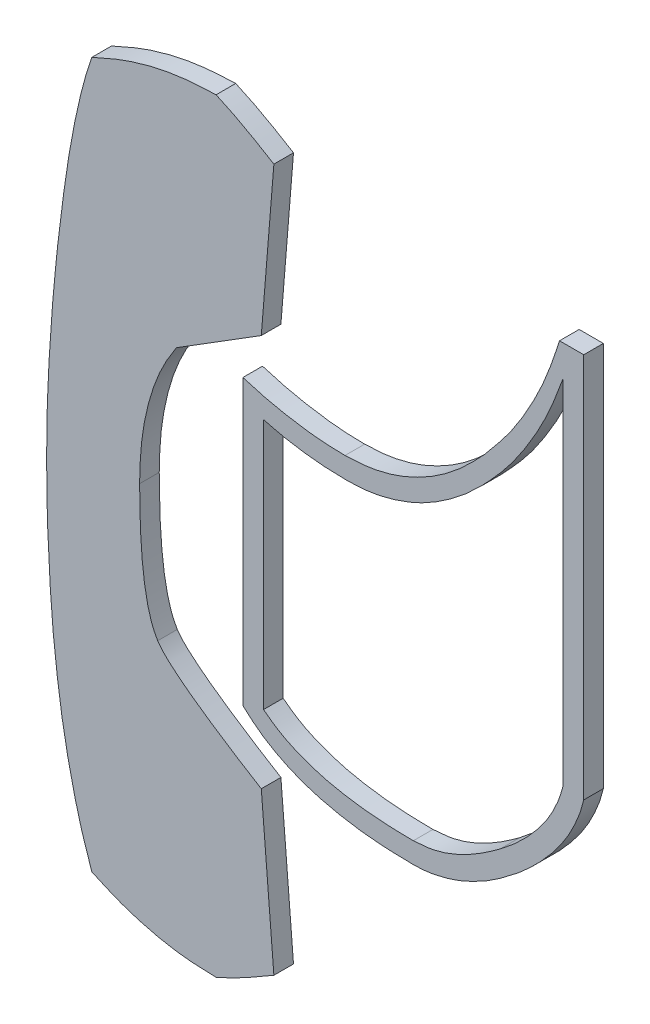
ISO-10303-21;
HEADER;
FILE_DESCRIPTION(('STEP AP214'),'2;1');
FILE_NAME('part.step','',(''),(''),'','','');
FILE_SCHEMA(('AUTOMOTIVE_DESIGN { 1 0 10303 214 1 1 1 1 }'));
ENDSEC;
DATA;
#1=APPLICATION_CONTEXT('core data for automotive mechanical design processes');
#2=APPLICATION_PROTOCOL_DEFINITION('international standard','automotive_design',2000,#1);
#3=PRODUCT_CONTEXT('',#1,'mechanical');
#4=PRODUCT('Part','Part','',(#3));
#5=PRODUCT_RELATED_PRODUCT_CATEGORY('part','',(#4));
#6=PRODUCT_DEFINITION_FORMATION('','',#4);
#7=PRODUCT_DEFINITION_CONTEXT('part definition',#1,'design');
#8=PRODUCT_DEFINITION('design','',#6,#7);
#9=PRODUCT_DEFINITION_SHAPE('','',#8);
#10=(LENGTH_UNIT() NAMED_UNIT(*) SI_UNIT(.MILLI.,.METRE.));
#11=(NAMED_UNIT(*) PLANE_ANGLE_UNIT() SI_UNIT($,.RADIAN.));
#12=(NAMED_UNIT(*) SI_UNIT($,.STERADIAN.) SOLID_ANGLE_UNIT());
#13=UNCERTAINTY_MEASURE_WITH_UNIT(LENGTH_MEASURE(1.E-05),#10,'distance_accuracy_value','');
#14=(GEOMETRIC_REPRESENTATION_CONTEXT(3) GLOBAL_UNCERTAINTY_ASSIGNED_CONTEXT((#13)) GLOBAL_UNIT_ASSIGNED_CONTEXT((#10,
#11,#12)) REPRESENTATION_CONTEXT('',''));
#15=CARTESIAN_POINT('',(0.,0.,0.));
#16=DIRECTION('',(0.,0.,1.));
#17=DIRECTION('',(1.,0.,0.));
#18=AXIS2_PLACEMENT_3D('',#15,#16,#17);
#19=CARTESIAN_POINT('',(10.9332873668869,2.60984481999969,1.));
#20=DIRECTION('',(0.996729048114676,0.080815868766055,0.));
#21=DIRECTION('',(-0.080815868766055,0.996729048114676,0.));
#22=AXIS2_PLACEMENT_3D('',#19,#20,#21);
#23=PLANE('',#22);
#24=DIRECTION('',(0.080815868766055,-0.996729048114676,0.));
#25=VECTOR('',#24,1.);
#26=CARTESIAN_POINT('',(10.9332873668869,2.60984481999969,0.));
#27=LINE('',#26,#25);
#28=CARTESIAN_POINT('',(10.9332873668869,2.60984481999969,0.));
#29=VERTEX_POINT('',#28);
#30=CARTESIAN_POINT('',(11.574734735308,-5.30133939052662,0.));
#31=VERTEX_POINT('',#30);
#32=EDGE_CURVE('E245',#29,#31,#27,.T.);
#33=ORIENTED_EDGE('',*,*,#32,.F.);
#34=DIRECTION('',(0.,0.,-1.));
#35=VECTOR('',#34,1.);
#36=CARTESIAN_POINT('',(10.9332873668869,2.60984481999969,1.));
#37=LINE('',#36,#35);
#38=CARTESIAN_POINT('',(10.9332873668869,2.60984481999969,1.));
#39=VERTEX_POINT('',#38);
#40=EDGE_CURVE('E12',#39,#29,#37,.T.);
#41=ORIENTED_EDGE('',*,*,#40,.F.);
#42=DIRECTION('',(0.080815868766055,-0.996729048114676,0.));
#43=VECTOR('',#42,1.);
#44=CARTESIAN_POINT('',(10.9332873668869,2.60984481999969,1.));
#45=LINE('',#44,#43);
#46=CARTESIAN_POINT('',(11.574734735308,-5.30133939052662,1.));
#47=VERTEX_POINT('',#46);
#48=EDGE_CURVE('E271',#39,#47,#45,.T.);
#49=ORIENTED_EDGE('',*,*,#48,.T.);
#50=DIRECTION('',(0.,0.,-1.));
#51=VECTOR('',#50,1.);
#52=CARTESIAN_POINT('',(11.574734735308,-5.30133939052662,1.));
#53=LINE('',#52,#51);
#54=EDGE_CURVE('E46',#47,#31,#53,.T.);
#55=ORIENTED_EDGE('',*,*,#54,.T.);
#56=EDGE_LOOP('',(#33,#41,#49,#55));
#57=FACE_BOUND('',#56,.T.);
#58=ADVANCED_FACE('F43',(#57),#23,.T.);
#59=CARTESIAN_POINT('',(5.65368210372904,6.49964745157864,1.));
#60=CARTESIAN_POINT('',(5.73052995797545,6.39590235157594,1.));
#61=CARTESIAN_POINT('',(5.90794783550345,6.15638707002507,1.));
#62=CARTESIAN_POINT('',(6.28429441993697,5.80972337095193,1.));
#63=CARTESIAN_POINT('',(6.76646383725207,5.40060071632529,1.));
#64=CARTESIAN_POINT('',(7.36969537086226,4.94225262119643,1.));
#65=CARTESIAN_POINT('',(8.08982174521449,4.43195486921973,1.));
#66=CARTESIAN_POINT('',(8.92737020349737,3.86478200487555,1.));
#67=CARTESIAN_POINT('',(9.8891243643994,3.25114417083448,1.));
#68=CARTESIAN_POINT('',(10.57351894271,2.83080577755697,1.));
#69=CARTESIAN_POINT('',(10.9332873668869,2.60984481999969,1.));
#70=B_SPLINE_CURVE_WITH_KNOTS('',3,(#59,#60,#61,#62,#63,#64,#65,#66,#67,#68,#69),.UNSPECIFIED.,
.F.,.F.,(4,1,1,1,1,1,1,1,4),(0.,0.0587011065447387,0.135522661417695,0.232091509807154,
0.346976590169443,0.480374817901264,0.63414472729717,0.807679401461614,1.),.UNSPECIFIED.);
#71=DIRECTION('',(0.,0.,-1.));
#72=VECTOR('',#71,1.);
#73=SURFACE_OF_LINEAR_EXTRUSION('',#70,#72);
#74=CARTESIAN_POINT('',(5.65368210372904,6.49964745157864,0.));
#75=CARTESIAN_POINT('',(5.73052995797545,6.39590235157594,0.));
#76=CARTESIAN_POINT('',(5.90794783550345,6.15638707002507,0.));
#77=CARTESIAN_POINT('',(6.28429441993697,5.80972337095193,0.));
#78=CARTESIAN_POINT('',(6.76646383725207,5.40060071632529,0.));
#79=CARTESIAN_POINT('',(7.36969537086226,4.94225262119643,0.));
#80=CARTESIAN_POINT('',(8.08982174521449,4.43195486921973,0.));
#81=CARTESIAN_POINT('',(8.92737020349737,3.86478200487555,0.));
#82=CARTESIAN_POINT('',(9.8891243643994,3.25114417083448,0.));
#83=CARTESIAN_POINT('',(10.57351894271,2.83080577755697,0.));
#84=CARTESIAN_POINT('',(10.9332873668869,2.60984481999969,0.));
#85=B_SPLINE_CURVE_WITH_KNOTS('',3,(#74,#75,#76,#77,#78,#79,#80,#81,#82,#83,#84),.UNSPECIFIED.,
.F.,.F.,(4,1,1,1,1,1,1,1,4),(0.,0.0587011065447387,0.135522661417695,0.232091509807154,
0.346976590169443,0.480374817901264,0.63414472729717,0.807679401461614,1.),.UNSPECIFIED.);
#86=CARTESIAN_POINT('',(5.65368210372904,6.49964745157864,0.));
#87=VERTEX_POINT('',#86);
#88=EDGE_CURVE('E270',#87,#29,#85,.T.);
#89=ORIENTED_EDGE('',*,*,#88,.F.);
#90=DIRECTION('',(0.,0.,-1.));
#91=VECTOR('',#90,1.);
#92=CARTESIAN_POINT('',(5.65368210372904,6.49964745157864,1.));
#93=LINE('',#92,#91);
#94=CARTESIAN_POINT('',(5.65368210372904,6.49964745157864,1.));
#95=VERTEX_POINT('',#94);
#96=EDGE_CURVE('E52',#95,#87,#93,.T.);
#97=ORIENTED_EDGE('',*,*,#96,.F.);
#98=EDGE_CURVE('E160',#95,#39,#70,.T.);
#99=ORIENTED_EDGE('',*,*,#98,.T.);
#100=ORIENTED_EDGE('',*,*,#40,.T.);
#101=EDGE_LOOP('',(#89,#97,#99,#100));
#102=FACE_BOUND('',#101,.T.);
#103=ADVANCED_FACE('F250',(#102),#73,.T.);
#104=CARTESIAN_POINT('',(4.7326294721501,12.9716869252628,1.));
#105=CARTESIAN_POINT('',(4.73637331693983,12.5687065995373,1.));
#106=CARTESIAN_POINT('',(4.74350652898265,11.8009012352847,1.));
#107=CARTESIAN_POINT('',(4.78068067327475,10.7062798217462,1.));
#108=CARTESIAN_POINT('',(4.85603248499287,9.72729729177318,1.));
#109=CARTESIAN_POINT('',(4.94970389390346,8.85925206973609,1.));
#110=CARTESIAN_POINT('',(5.07907703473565,8.10647959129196,1.));
#111=CARTESIAN_POINT('',(5.233149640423,7.46485264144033,1.));
#112=CARTESIAN_POINT('',(5.4128332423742,6.93348073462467,1.));
#113=CARTESIAN_POINT('',(5.57857515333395,6.6349351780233,1.));
#114=CARTESIAN_POINT('',(5.65368210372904,6.49964745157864,1.));
#115=B_SPLINE_CURVE_WITH_KNOTS('',3,(#104,#105,#106,#107,#108,#109,#110,#111,#112,#113,#114),
.UNSPECIFIED.,.F.,.F.,(4,1,1,1,1,1,1,1,4),(0.,0.183266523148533,0.349180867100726,
0.497949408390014,0.629693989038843,0.746102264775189,0.844969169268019,0.929746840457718,1.),.UNSPECIFIED.);
#116=DIRECTION('',(0.,0.,-1.));
#117=VECTOR('',#116,1.);
#118=SURFACE_OF_LINEAR_EXTRUSION('',#115,#117);
#119=CARTESIAN_POINT('',(4.7326294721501,12.9716869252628,0.));
#120=CARTESIAN_POINT('',(4.73637331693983,12.5687065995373,0.));
#121=CARTESIAN_POINT('',(4.74350652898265,11.8009012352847,0.));
#122=CARTESIAN_POINT('',(4.78068067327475,10.7062798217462,0.));
#123=CARTESIAN_POINT('',(4.85603248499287,9.72729729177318,0.));
#124=CARTESIAN_POINT('',(4.94970389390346,8.85925206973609,0.));
#125=CARTESIAN_POINT('',(5.07907703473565,8.10647959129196,0.));
#126=CARTESIAN_POINT('',(5.233149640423,7.46485264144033,0.));
#127=CARTESIAN_POINT('',(5.4128332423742,6.93348073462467,0.));
#128=CARTESIAN_POINT('',(5.57857515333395,6.6349351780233,0.));
#129=CARTESIAN_POINT('',(5.65368210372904,6.49964745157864,0.));
#130=B_SPLINE_CURVE_WITH_KNOTS('',3,(#119,#120,#121,#122,#123,#124,#125,#126,#127,#128,#129),
.UNSPECIFIED.,.F.,.F.,(4,1,1,1,1,1,1,1,4),(0.,0.183266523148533,0.349180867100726,
0.497949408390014,0.629693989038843,0.746102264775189,0.844969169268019,0.929746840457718,1.),.UNSPECIFIED.);
#131=CARTESIAN_POINT('',(4.7326294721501,12.9716869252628,0.));
#132=VERTEX_POINT('',#131);
#133=EDGE_CURVE('E147',#132,#87,#130,.T.);
#134=ORIENTED_EDGE('',*,*,#133,.F.);
#135=DIRECTION('',(0.,0.,-1.));
#136=VECTOR('',#135,1.);
#137=CARTESIAN_POINT('',(4.7326294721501,12.9716869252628,1.));
#138=LINE('',#137,#136);
#139=CARTESIAN_POINT('',(4.7326294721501,12.9716869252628,1.));
#140=VERTEX_POINT('',#139);
#141=EDGE_CURVE('E142',#140,#132,#138,.T.);
#142=ORIENTED_EDGE('',*,*,#141,.F.);
#143=EDGE_CURVE('E145',#140,#95,#115,.T.);
#144=ORIENTED_EDGE('',*,*,#143,.T.);
#145=ORIENTED_EDGE('',*,*,#96,.T.);
#146=EDGE_LOOP('',(#134,#142,#144,#145));
#147=FACE_BOUND('',#146,.T.);
#148=ADVANCED_FACE('F144',(#147),#118,.T.);
#149=CARTESIAN_POINT('',(6.6076294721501,19.9124763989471,1.));
#150=CARTESIAN_POINT('',(6.45851238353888,19.6789972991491,1.));
#151=CARTESIAN_POINT('',(6.15689728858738,19.2067454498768,1.));
#152=CARTESIAN_POINT('',(5.77205604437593,18.4508114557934,1.));
#153=CARTESIAN_POINT('',(5.45041621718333,17.6463159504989,1.));
#154=CARTESIAN_POINT('',(5.18861503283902,16.7988062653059,1.));
#155=CARTESIAN_POINT('',(4.98293904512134,15.9055582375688,1.));
#156=CARTESIAN_POINT('',(4.83407070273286,14.9688344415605,1.));
#157=CARTESIAN_POINT('',(4.754999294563,13.9845567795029,1.));
#158=CARTESIAN_POINT('',(4.74019997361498,13.3144671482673,1.));
#159=CARTESIAN_POINT('',(4.7326294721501,12.9716869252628,1.));
#160=B_SPLINE_CURVE_WITH_KNOTS('',3,(#149,#150,#151,#152,#153,#154,#155,#156,#157,#158,#159),
.UNSPECIFIED.,.F.,.F.,(4,1,1,1,1,1,1,1,4),(0.,0.11382711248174,0.230235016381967,
0.348036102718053,0.469566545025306,0.594476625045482,0.724520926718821,0.859080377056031,1.),.UNSPECIFIED.);
#161=DIRECTION('',(0.,0.,-1.));
#162=VECTOR('',#161,1.);
#163=SURFACE_OF_LINEAR_EXTRUSION('',#160,#162);
#164=CARTESIAN_POINT('',(6.6076294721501,19.9124763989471,0.));
#165=CARTESIAN_POINT('',(6.45851238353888,19.6789972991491,0.));
#166=CARTESIAN_POINT('',(6.15689728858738,19.2067454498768,0.));
#167=CARTESIAN_POINT('',(5.77205604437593,18.4508114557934,0.));
#168=CARTESIAN_POINT('',(5.45041621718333,17.6463159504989,0.));
#169=CARTESIAN_POINT('',(5.18861503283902,16.7988062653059,0.));
#170=CARTESIAN_POINT('',(4.98293904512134,15.9055582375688,0.));
#171=CARTESIAN_POINT('',(4.83407070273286,14.9688344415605,0.));
#172=CARTESIAN_POINT('',(4.754999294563,13.9845567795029,0.));
#173=CARTESIAN_POINT('',(4.74019997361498,13.3144671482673,0.));
#174=CARTESIAN_POINT('',(4.7326294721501,12.9716869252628,0.));
#175=B_SPLINE_CURVE_WITH_KNOTS('',3,(#164,#165,#166,#167,#168,#169,#170,#171,#172,#173,#174),
.UNSPECIFIED.,.F.,.F.,(4,1,1,1,1,1,1,1,4),(0.,0.11382711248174,0.230235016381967,
0.348036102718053,0.469566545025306,0.594476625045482,0.724520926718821,0.859080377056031,1.),.UNSPECIFIED.);
#176=CARTESIAN_POINT('',(6.6076294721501,19.9124763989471,0.));
#177=VERTEX_POINT('',#176);
#178=EDGE_CURVE('E275',#177,#132,#175,.T.);
#179=ORIENTED_EDGE('',*,*,#178,.F.);
#180=DIRECTION('',(0.,0.,-1.));
#181=VECTOR('',#180,1.);
#182=CARTESIAN_POINT('',(6.6076294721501,19.9124763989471,1.));
#183=LINE('',#182,#181);
#184=CARTESIAN_POINT('',(6.6076294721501,19.9124763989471,1.));
#185=VERTEX_POINT('',#184);
#186=EDGE_CURVE('E152',#185,#177,#183,.T.);
#187=ORIENTED_EDGE('',*,*,#186,.F.);
#188=EDGE_CURVE('E158',#185,#140,#160,.T.);
#189=ORIENTED_EDGE('',*,*,#188,.T.);
#190=ORIENTED_EDGE('',*,*,#141,.T.);
#191=EDGE_LOOP('',(#179,#187,#189,#190));
#192=FACE_BOUND('',#191,.T.);
#193=ADVANCED_FACE('F162',(#192),#163,.T.);
#194=CARTESIAN_POINT('',(10.9332873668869,22.6098448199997,1.));
#195=DIRECTION('',(0.529128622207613,-0.848541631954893,0.));
#196=DIRECTION('',(0.848541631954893,0.529128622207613,0.));
#197=AXIS2_PLACEMENT_3D('',#194,#195,#196);
#198=PLANE('',#197);
#199=DIRECTION('',(-0.848541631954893,-0.529128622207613,0.));
#200=VECTOR('',#199,1.);
#201=CARTESIAN_POINT('',(10.9332873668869,22.6098448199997,0.));
#202=LINE('',#201,#200);
#203=CARTESIAN_POINT('',(10.9332873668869,22.6098448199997,0.));
#204=VERTEX_POINT('',#203);
#205=EDGE_CURVE('E288',#204,#177,#202,.T.);
#206=ORIENTED_EDGE('',*,*,#205,.F.);
#207=DIRECTION('',(0.,0.,-1.));
#208=VECTOR('',#207,1.);
#209=CARTESIAN_POINT('',(10.9332873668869,22.6098448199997,1.));
#210=LINE('',#209,#208);
#211=CARTESIAN_POINT('',(10.9332873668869,22.6098448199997,1.));
#212=VERTEX_POINT('',#211);
#213=EDGE_CURVE('E215',#212,#204,#210,.T.);
#214=ORIENTED_EDGE('',*,*,#213,.F.);
#215=DIRECTION('',(-0.848541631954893,-0.529128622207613,0.));
#216=VECTOR('',#215,1.);
#217=CARTESIAN_POINT('',(10.9332873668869,22.6098448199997,1.));
#218=LINE('',#217,#216);
#219=EDGE_CURVE('E163',#212,#185,#218,.T.);
#220=ORIENTED_EDGE('',*,*,#219,.T.);
#221=ORIENTED_EDGE('',*,*,#186,.T.);
#222=EDGE_LOOP('',(#206,#214,#220,#221));
#223=FACE_BOUND('',#222,.T.);
#224=ADVANCED_FACE('F182',(#223),#198,.T.);
#225=CARTESIAN_POINT('',(11.574734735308,30.4963579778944,1.));
#226=DIRECTION('',(0.996708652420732,-0.081067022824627,0.));
#227=DIRECTION('',(0.081067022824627,0.996708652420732,0.));
#228=AXIS2_PLACEMENT_3D('',#225,#226,#227);
#229=PLANE('',#228);
#230=DIRECTION('',(-0.081067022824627,-0.996708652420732,0.));
#231=VECTOR('',#230,1.);
#232=CARTESIAN_POINT('',(11.574734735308,30.4963579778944,0.));
#233=LINE('',#232,#231);
#234=CARTESIAN_POINT('',(11.574734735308,30.4963579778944,0.));
#235=VERTEX_POINT('',#234);
#236=EDGE_CURVE('E290',#235,#204,#233,.T.);
#237=ORIENTED_EDGE('',*,*,#236,.F.);
#238=DIRECTION('',(0.,0.,-1.));
#239=VECTOR('',#238,1.);
#240=CARTESIAN_POINT('',(11.574734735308,30.4963579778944,1.));
#241=LINE('',#240,#239);
#242=CARTESIAN_POINT('',(11.574734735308,30.4963579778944,1.));
#243=VERTEX_POINT('',#242);
#244=EDGE_CURVE('E217',#243,#235,#241,.T.);
#245=ORIENTED_EDGE('',*,*,#244,.F.);
#246=DIRECTION('',(-0.081067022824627,-0.996708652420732,0.));
#247=VECTOR('',#246,1.);
#248=CARTESIAN_POINT('',(11.574734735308,30.4963579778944,1.));
#249=LINE('',#248,#247);
#250=EDGE_CURVE('E165',#243,#212,#249,.T.);
#251=ORIENTED_EDGE('',*,*,#250,.T.);
#252=ORIENTED_EDGE('',*,*,#213,.T.);
#253=EDGE_LOOP('',(#237,#245,#251,#252));
#254=FACE_BOUND('',#253,.T.);
#255=ADVANCED_FACE('F186',(#254),#229,.T.);
#256=CARTESIAN_POINT('',(8.63065578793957,32.083529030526,1.));
#257=CARTESIAN_POINT('',(8.82335423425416,31.9975150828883,1.));
#258=CARTESIAN_POINT('',(9.2523112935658,31.8060434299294,1.));
#259=CARTESIAN_POINT('',(9.9338769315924,31.4515535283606,1.));
#260=CARTESIAN_POINT('',(10.7242096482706,31.0109215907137,1.));
#261=CARTESIAN_POINT('',(11.2770548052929,30.6764529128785,1.));
#262=CARTESIAN_POINT('',(11.574734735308,30.4963579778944,1.));
#263=B_SPLINE_CURVE_WITH_KNOTS('',3,(#256,#257,#258,#259,#260,#261,#262),.UNSPECIFIED.,.F.,.F.,
(4,1,1,1,4),(0.,0.189096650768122,0.420939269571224,0.688204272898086,1.),.UNSPECIFIED.);
#264=DIRECTION('',(0.,0.,-1.));
#265=VECTOR('',#264,1.);
#266=SURFACE_OF_LINEAR_EXTRUSION('',#263,#265);
#267=CARTESIAN_POINT('',(8.63065578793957,32.083529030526,0.));
#268=CARTESIAN_POINT('',(8.82335423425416,31.9975150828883,0.));
#269=CARTESIAN_POINT('',(9.2523112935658,31.8060434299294,0.));
#270=CARTESIAN_POINT('',(9.9338769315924,31.4515535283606,0.));
#271=CARTESIAN_POINT('',(10.7242096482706,31.0109215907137,0.));
#272=CARTESIAN_POINT('',(11.2770548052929,30.6764529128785,0.));
#273=CARTESIAN_POINT('',(11.574734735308,30.4963579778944,0.));
#274=B_SPLINE_CURVE_WITH_KNOTS('',3,(#267,#268,#269,#270,#271,#272,#273),.UNSPECIFIED.,.F.,.F.,
(4,1,1,1,4),(0.,0.189096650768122,0.420939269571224,0.688204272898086,1.),.UNSPECIFIED.);
#275=CARTESIAN_POINT('',(8.63065578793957,32.083529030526,0.));
#276=VERTEX_POINT('',#275);
#277=EDGE_CURVE('E224',#276,#235,#274,.T.);
#278=ORIENTED_EDGE('',*,*,#277,.F.);
#279=DIRECTION('',(0.,0.,-1.));
#280=VECTOR('',#279,1.);
#281=CARTESIAN_POINT('',(8.63065578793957,32.083529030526,1.));
#282=LINE('',#281,#280);
#283=CARTESIAN_POINT('',(8.63065578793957,32.083529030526,1.));
#284=VERTEX_POINT('',#283);
#285=EDGE_CURVE('E222',#284,#276,#282,.T.);
#286=ORIENTED_EDGE('',*,*,#285,.F.);
#287=EDGE_CURVE('E199',#284,#243,#263,.T.);
#288=ORIENTED_EDGE('',*,*,#287,.T.);
#289=ORIENTED_EDGE('',*,*,#244,.T.);
#290=EDGE_LOOP('',(#278,#286,#288,#289));
#291=FACE_BOUND('',#290,.T.);
#292=ADVANCED_FACE('F190',(#291),#266,.T.);
#293=CARTESIAN_POINT('',(2.29841894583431,30.5703711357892,1.));
#294=CARTESIAN_POINT('',(2.80384619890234,30.7982582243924,1.));
#295=CARTESIAN_POINT('',(3.8085241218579,31.2512475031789,1.));
#296=CARTESIAN_POINT('',(5.38426886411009,31.7261886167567,1.));
#297=CARTESIAN_POINT('',(6.99744730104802,32.0134789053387,1.));
#298=CARTESIAN_POINT('',(8.08399850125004,32.0600822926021,1.));
#299=CARTESIAN_POINT('',(8.63065578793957,32.083529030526,1.));
#300=B_SPLINE_CURVE_WITH_KNOTS('',3,(#293,#294,#295,#296,#297,#298,#299),.UNSPECIFIED.,.F.,.F.,
(4,1,1,1,4),(0.,0.253211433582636,0.50332849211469,0.750118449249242,1.),.UNSPECIFIED.);
#301=DIRECTION('',(0.,0.,-1.));
#302=VECTOR('',#301,1.);
#303=SURFACE_OF_LINEAR_EXTRUSION('',#300,#302);
#304=CARTESIAN_POINT('',(2.29841894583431,30.5703711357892,0.));
#305=CARTESIAN_POINT('',(2.80384619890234,30.7982582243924,0.));
#306=CARTESIAN_POINT('',(3.8085241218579,31.2512475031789,0.));
#307=CARTESIAN_POINT('',(5.38426886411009,31.7261886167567,0.));
#308=CARTESIAN_POINT('',(6.99744730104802,32.0134789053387,0.));
#309=CARTESIAN_POINT('',(8.08399850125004,32.0600822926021,0.));
#310=CARTESIAN_POINT('',(8.63065578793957,32.083529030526,0.));
#311=B_SPLINE_CURVE_WITH_KNOTS('',3,(#304,#305,#306,#307,#308,#309,#310),.UNSPECIFIED.,.F.,.F.,
(4,1,1,1,4),(0.,0.253211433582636,0.50332849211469,0.750118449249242,1.),.UNSPECIFIED.);
#312=CARTESIAN_POINT('',(2.29841894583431,30.5703711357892,0.));
#313=VERTEX_POINT('',#312);
#314=EDGE_CURVE('E302',#313,#276,#311,.T.);
#315=ORIENTED_EDGE('',*,*,#314,.F.);
#316=DIRECTION('',(0.,0.,-1.));
#317=VECTOR('',#316,1.);
#318=CARTESIAN_POINT('',(2.29841894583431,30.5703711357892,1.));
#319=LINE('',#318,#317);
#320=CARTESIAN_POINT('',(2.29841894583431,30.5703711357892,1.));
#321=VERTEX_POINT('',#320);
#322=EDGE_CURVE('E228',#321,#313,#319,.T.);
#323=ORIENTED_EDGE('',*,*,#322,.F.);
#324=EDGE_CURVE('E204',#321,#284,#300,.T.);
#325=ORIENTED_EDGE('',*,*,#324,.T.);
#326=ORIENTED_EDGE('',*,*,#285,.T.);
#327=EDGE_LOOP('',(#315,#323,#325,#326));
#328=FACE_BOUND('',#327,.T.);
#329=ADVANCED_FACE('F195',(#328),#303,.T.);
#330=CARTESIAN_POINT('',(0.554997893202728,21.3845158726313,1.));
#331=CARTESIAN_POINT('',(0.613637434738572,21.8891120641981,1.));
#332=CARTESIAN_POINT('',(0.726875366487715,22.8635301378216,1.));
#333=CARTESIAN_POINT('',(0.918034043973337,24.2723971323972,1.));
#334=CARTESIAN_POINT('',(1.11012856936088,25.5787761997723,1.));
#335=CARTESIAN_POINT('',(1.32643914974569,26.7788735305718,1.));
#336=CARTESIAN_POINT('',(1.54451984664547,27.8772576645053,1.));
#337=CARTESIAN_POINT('',(1.78396738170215,28.8692716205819,1.));
#338=CARTESIAN_POINT('',(2.02542944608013,29.7598133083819,1.));
#339=CARTESIAN_POINT('',(2.21096934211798,30.3107166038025,1.));
#340=CARTESIAN_POINT('',(2.29841894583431,30.5703711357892,1.));
#341=B_SPLINE_CURVE_WITH_KNOTS('',3,(#330,#331,#332,#333,#334,#335,#336,#337,#338,#339,#340),
.UNSPECIFIED.,.F.,.F.,(4,1,1,1,1,1,1,1,4),(0.,0.162680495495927,0.314149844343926,
0.455313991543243,0.585501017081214,0.704640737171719,0.813872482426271,0.912273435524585,1.),.UNSPECIFIED.);
#342=DIRECTION('',(0.,0.,-1.));
#343=VECTOR('',#342,1.);
#344=SURFACE_OF_LINEAR_EXTRUSION('',#341,#343);
#345=CARTESIAN_POINT('',(0.554997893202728,21.3845158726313,0.));
#346=CARTESIAN_POINT('',(0.613637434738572,21.8891120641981,0.));
#347=CARTESIAN_POINT('',(0.726875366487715,22.8635301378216,0.));
#348=CARTESIAN_POINT('',(0.918034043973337,24.2723971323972,0.));
#349=CARTESIAN_POINT('',(1.11012856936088,25.5787761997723,0.));
#350=CARTESIAN_POINT('',(1.32643914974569,26.7788735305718,0.));
#351=CARTESIAN_POINT('',(1.54451984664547,27.8772576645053,0.));
#352=CARTESIAN_POINT('',(1.78396738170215,28.8692716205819,0.));
#353=CARTESIAN_POINT('',(2.02542944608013,29.7598133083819,0.));
#354=CARTESIAN_POINT('',(2.21096934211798,30.3107166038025,0.));
#355=CARTESIAN_POINT('',(2.29841894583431,30.5703711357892,0.));
#356=B_SPLINE_CURVE_WITH_KNOTS('',3,(#345,#346,#347,#348,#349,#350,#351,#352,#353,#354,#355),
.UNSPECIFIED.,.F.,.F.,(4,1,1,1,1,1,1,1,4),(0.,0.162680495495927,0.314149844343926,
0.455313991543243,0.585501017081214,0.704640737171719,0.813872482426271,0.912273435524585,1.),.UNSPECIFIED.);
#357=CARTESIAN_POINT('',(0.554997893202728,21.3845158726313,0.));
#358=VERTEX_POINT('',#357);
#359=EDGE_CURVE('E309',#358,#313,#356,.T.);
#360=ORIENTED_EDGE('',*,*,#359,.F.);
#361=DIRECTION('',(0.,0.,-1.));
#362=VECTOR('',#361,1.);
#363=CARTESIAN_POINT('',(0.554997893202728,21.3845158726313,1.));
#364=LINE('',#363,#362);
#365=CARTESIAN_POINT('',(0.554997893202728,21.3845158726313,1.));
#366=VERTEX_POINT('',#365);
#367=EDGE_CURVE('E231',#366,#358,#364,.T.);
#368=ORIENTED_EDGE('',*,*,#367,.F.);
#369=EDGE_CURVE('E368',#366,#321,#341,.T.);
#370=ORIENTED_EDGE('',*,*,#369,.T.);
#371=ORIENTED_EDGE('',*,*,#322,.T.);
#372=EDGE_LOOP('',(#360,#368,#370,#371));
#373=FACE_BOUND('',#372,.T.);
#374=ADVANCED_FACE('F365',(#373),#344,.T.);
#375=CARTESIAN_POINT('',(-0.00421263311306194,11.8943842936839,1.));
#376=CARTESIAN_POINT('',(0.00173893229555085,12.6236868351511,1.));
#377=CARTESIAN_POINT('',(0.0139836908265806,14.1241548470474,1.));
#378=CARTESIAN_POINT('',(0.131046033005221,16.4354645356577,1.));
#379=CARTESIAN_POINT('',(0.298036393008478,18.8710274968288,1.));
#380=CARTESIAN_POINT('',(0.467884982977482,20.5324143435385,1.));
#381=CARTESIAN_POINT('',(0.554997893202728,21.3845158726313,1.));
#382=B_SPLINE_CURVE_WITH_KNOTS('',3,(#375,#376,#377,#378,#379,#380,#381),.UNSPECIFIED.,.F.,.F.,
(4,1,1,1,4),(0.,0.230026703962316,0.473257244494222,0.729841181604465,1.),.UNSPECIFIED.);
#383=DIRECTION('',(0.,0.,-1.));
#384=VECTOR('',#383,1.);
#385=SURFACE_OF_LINEAR_EXTRUSION('',#382,#384);
#386=CARTESIAN_POINT('',(-0.00421263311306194,11.8943842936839,0.));
#387=CARTESIAN_POINT('',(0.00173893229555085,12.6236868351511,0.));
#388=CARTESIAN_POINT('',(0.0139836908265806,14.1241548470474,0.));
#389=CARTESIAN_POINT('',(0.131046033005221,16.4354645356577,0.));
#390=CARTESIAN_POINT('',(0.298036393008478,18.8710274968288,0.));
#391=CARTESIAN_POINT('',(0.467884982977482,20.5324143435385,0.));
#392=CARTESIAN_POINT('',(0.554997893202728,21.3845158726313,0.));
#393=B_SPLINE_CURVE_WITH_KNOTS('',3,(#386,#387,#388,#389,#390,#391,#392),.UNSPECIFIED.,.F.,.F.,
(4,1,1,1,4),(0.,0.230026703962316,0.473257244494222,0.729841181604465,1.),.UNSPECIFIED.);
#394=CARTESIAN_POINT('',(-0.00421263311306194,11.8943842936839,0.));
#395=VERTEX_POINT('',#394);
#396=EDGE_CURVE('E317',#395,#358,#393,.T.);
#397=ORIENTED_EDGE('',*,*,#396,.F.);
#398=DIRECTION('',(0.,0.,-1.));
#399=VECTOR('',#398,1.);
#400=CARTESIAN_POINT('',(-0.00421263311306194,11.8943842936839,1.));
#401=LINE('',#400,#399);
#402=CARTESIAN_POINT('',(-0.00421263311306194,11.8943842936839,1.));
#403=VERTEX_POINT('',#402);
#404=EDGE_CURVE('E236',#403,#395,#401,.T.);
#405=ORIENTED_EDGE('',*,*,#404,.F.);
#406=EDGE_CURVE('E382',#403,#366,#382,.T.);
#407=ORIENTED_EDGE('',*,*,#406,.T.);
#408=ORIENTED_EDGE('',*,*,#367,.T.);
#409=EDGE_LOOP('',(#397,#405,#407,#408));
#410=FACE_BOUND('',#409,.T.);
#411=ADVANCED_FACE('F362',(#410),#385,.T.);
#412=CARTESIAN_POINT('',(2.29841894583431,-5.37535254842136,1.));
#413=CARTESIAN_POINT('',(2.10928863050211,-4.82406892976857,1.));
#414=CARTESIAN_POINT('',(1.71897966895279,-3.68638279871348,1.));
#415=CARTESIAN_POINT('',(1.27668714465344,-1.8750189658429,1.));
#416=CARTESIAN_POINT('',(0.862960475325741,0.0666688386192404,1.));
#417=CARTESIAN_POINT('',(0.555329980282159,2.15805647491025,1.));
#418=CARTESIAN_POINT('',(0.292761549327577,4.38963550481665,1.));
#419=CARTESIAN_POINT('',(0.134626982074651,6.76664628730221,1.));
#420=CARTESIAN_POINT('',(0.00762526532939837,9.28337458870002,1.));
#421=CARTESIAN_POINT('',(-0.000197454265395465,11.008781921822,1.));
#422=CARTESIAN_POINT('',(-0.00421263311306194,11.8943842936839,1.));
#423=B_SPLINE_CURVE_WITH_KNOTS('',3,(#412,#413,#414,#415,#416,#417,#418,#419,#420,#421,#422),
.UNSPECIFIED.,.F.,.F.,(4,1,1,1,1,1,1,1,4),(0.,0.0998425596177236,0.206045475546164,
0.31928957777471,0.440024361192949,0.56817803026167,0.704316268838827,0.848233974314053,1.),.UNSPECIFIED.);
#424=DIRECTION('',(0.,0.,-1.));
#425=VECTOR('',#424,1.);
#426=SURFACE_OF_LINEAR_EXTRUSION('',#423,#425);
#427=CARTESIAN_POINT('',(2.29841894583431,-5.37535254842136,0.));
#428=CARTESIAN_POINT('',(2.10928863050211,-4.82406892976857,0.));
#429=CARTESIAN_POINT('',(1.71897966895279,-3.68638279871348,0.));
#430=CARTESIAN_POINT('',(1.27668714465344,-1.8750189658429,0.));
#431=CARTESIAN_POINT('',(0.862960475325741,0.0666688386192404,0.));
#432=CARTESIAN_POINT('',(0.555329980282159,2.15805647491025,0.));
#433=CARTESIAN_POINT('',(0.292761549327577,4.38963550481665,0.));
#434=CARTESIAN_POINT('',(0.134626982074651,6.76664628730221,0.));
#435=CARTESIAN_POINT('',(0.00762526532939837,9.28337458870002,0.));
#436=CARTESIAN_POINT('',(-0.000197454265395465,11.008781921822,0.));
#437=CARTESIAN_POINT('',(-0.00421263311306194,11.8943842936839,0.));
#438=B_SPLINE_CURVE_WITH_KNOTS('',3,(#427,#428,#429,#430,#431,#432,#433,#434,#435,#436,#437),
.UNSPECIFIED.,.F.,.F.,(4,1,1,1,1,1,1,1,4),(0.,0.0998425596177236,0.206045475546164,
0.31928957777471,0.440024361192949,0.56817803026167,0.704316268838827,0.848233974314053,1.),.UNSPECIFIED.);
#439=CARTESIAN_POINT('',(2.29841894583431,-5.37535254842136,0.));
#440=VERTEX_POINT('',#439);
#441=EDGE_CURVE('E325',#440,#395,#438,.T.);
#442=ORIENTED_EDGE('',*,*,#441,.F.);
#443=DIRECTION('',(0.,0.,-1.));
#444=VECTOR('',#443,1.);
#445=CARTESIAN_POINT('',(2.29841894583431,-5.37535254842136,1.));
#446=LINE('',#445,#444);
#447=CARTESIAN_POINT('',(2.29841894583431,-5.37535254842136,1.));
#448=VERTEX_POINT('',#447);
#449=EDGE_CURVE('E238',#448,#440,#446,.T.);
#450=ORIENTED_EDGE('',*,*,#449,.F.);
#451=EDGE_CURVE('E358',#448,#403,#423,.T.);
#452=ORIENTED_EDGE('',*,*,#451,.T.);
#453=ORIENTED_EDGE('',*,*,#404,.T.);
#454=EDGE_LOOP('',(#442,#450,#452,#453));
#455=FACE_BOUND('',#454,.T.);
#456=ADVANCED_FACE('F356',(#455),#426,.T.);
#457=CARTESIAN_POINT('',(8.63065578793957,-6.86383939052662,1.));
#458=CARTESIAN_POINT('',(8.08384419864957,-6.84755576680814,1.));
#459=CARTESIAN_POINT('',(6.99666010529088,-6.81518027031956,1.));
#460=CARTESIAN_POINT('',(5.38590945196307,-6.51929739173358,1.));
#461=CARTESIAN_POINT('',(3.80699214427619,-6.05883020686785,1.));
#462=CARTESIAN_POINT('',(2.80357463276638,-5.60421955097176,1.));
#463=CARTESIAN_POINT('',(2.29841894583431,-5.37535254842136,1.));
#464=B_SPLINE_CURVE_WITH_KNOTS('',3,(#457,#458,#459,#460,#461,#462,#463),.UNSPECIFIED.,.F.,.F.,
(4,1,1,1,4),(0.,0.24985864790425,0.496775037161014,0.746658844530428,1.),.UNSPECIFIED.);
#465=DIRECTION('',(0.,0.,-1.));
#466=VECTOR('',#465,1.);
#467=SURFACE_OF_LINEAR_EXTRUSION('',#464,#466);
#468=CARTESIAN_POINT('',(8.63065578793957,-6.86383939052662,0.));
#469=CARTESIAN_POINT('',(8.08384419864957,-6.84755576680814,0.));
#470=CARTESIAN_POINT('',(6.99666010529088,-6.81518027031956,0.));
#471=CARTESIAN_POINT('',(5.38590945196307,-6.51929739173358,0.));
#472=CARTESIAN_POINT('',(3.80699214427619,-6.05883020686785,0.));
#473=CARTESIAN_POINT('',(2.80357463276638,-5.60421955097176,0.));
#474=CARTESIAN_POINT('',(2.29841894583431,-5.37535254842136,0.));
#475=B_SPLINE_CURVE_WITH_KNOTS('',3,(#468,#469,#470,#471,#472,#473,#474),.UNSPECIFIED.,.F.,.F.,
(4,1,1,1,4),(0.,0.24985864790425,0.496775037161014,0.746658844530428,1.),.UNSPECIFIED.);
#476=CARTESIAN_POINT('',(8.63065578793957,-6.86383939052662,0.));
#477=VERTEX_POINT('',#476);
#478=EDGE_CURVE('E333',#477,#440,#475,.T.);
#479=ORIENTED_EDGE('',*,*,#478,.F.);
#480=DIRECTION('',(0.,0.,-1.));
#481=VECTOR('',#480,1.);
#482=CARTESIAN_POINT('',(8.63065578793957,-6.86383939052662,1.));
#483=LINE('',#482,#481);
#484=CARTESIAN_POINT('',(8.63065578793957,-6.86383939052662,1.));
#485=VERTEX_POINT('',#484);
#486=EDGE_CURVE('E239',#485,#477,#483,.T.);
#487=ORIENTED_EDGE('',*,*,#486,.F.);
#488=EDGE_CURVE('E352',#485,#448,#464,.T.);
#489=ORIENTED_EDGE('',*,*,#488,.T.);
#490=ORIENTED_EDGE('',*,*,#449,.T.);
#491=EDGE_LOOP('',(#479,#487,#489,#490));
#492=FACE_BOUND('',#491,.T.);
#493=ADVANCED_FACE('F262',(#492),#467,.T.);
#494=CARTESIAN_POINT('',(11.574734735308,-5.30133939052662,1.));
#495=CARTESIAN_POINT('',(11.2762013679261,-5.47445553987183,1.));
#496=CARTESIAN_POINT('',(10.719712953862,-5.79715692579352,1.));
#497=CARTESIAN_POINT('',(9.93672634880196,-6.2428847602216,1.));
#498=CARTESIAN_POINT('',(9.2502480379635,-6.58503249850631,1.));
#499=CARTESIAN_POINT('',(8.82306450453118,-6.77725845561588,1.));
#500=CARTESIAN_POINT('',(8.63065578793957,-6.86383939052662,1.));
#501=B_SPLINE_CURVE_WITH_KNOTS('',3,(#494,#495,#496,#497,#498,#499,#500),.UNSPECIFIED.,.F.,.F.,
(4,1,1,1,4),(0.,0.310424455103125,0.578654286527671,0.810220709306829,1.),.UNSPECIFIED.);
#502=DIRECTION('',(0.,0.,-1.));
#503=VECTOR('',#502,1.);
#504=SURFACE_OF_LINEAR_EXTRUSION('',#501,#503);
#505=CARTESIAN_POINT('',(11.574734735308,-5.30133939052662,0.));
#506=CARTESIAN_POINT('',(11.2762013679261,-5.47445553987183,0.));
#507=CARTESIAN_POINT('',(10.719712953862,-5.79715692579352,0.));
#508=CARTESIAN_POINT('',(9.93672634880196,-6.2428847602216,0.));
#509=CARTESIAN_POINT('',(9.2502480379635,-6.58503249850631,0.));
#510=CARTESIAN_POINT('',(8.82306450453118,-6.77725845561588,0.));
#511=CARTESIAN_POINT('',(8.63065578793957,-6.86383939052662,0.));
#512=B_SPLINE_CURVE_WITH_KNOTS('',3,(#505,#506,#507,#508,#509,#510,#511),.UNSPECIFIED.,.F.,.F.,
(4,1,1,1,4),(0.,0.310424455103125,0.578654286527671,0.810220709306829,1.),.UNSPECIFIED.);
#513=EDGE_CURVE('E269',#31,#477,#512,.T.);
#514=ORIENTED_EDGE('',*,*,#513,.F.);
#515=ORIENTED_EDGE('',*,*,#54,.F.);
#516=EDGE_CURVE('E273',#47,#485,#501,.T.);
#517=ORIENTED_EDGE('',*,*,#516,.T.);
#518=ORIENTED_EDGE('',*,*,#486,.T.);
#519=EDGE_LOOP('',(#514,#515,#517,#518));
#520=FACE_BOUND('',#519,.T.);
#521=ADVANCED_FACE('F258',(#520),#504,.T.);
#522=CARTESIAN_POINT('',(10.127831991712,-6.13047790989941,1.));
#523=DIRECTION('',(0.,0.,1.));
#524=DIRECTION('',(1.,0.,0.));
#525=AXIS2_PLACEMENT_3D('',#522,#523,#524);
#526=PLANE('',#525);
#527=ORIENTED_EDGE('',*,*,#48,.F.);
#528=ORIENTED_EDGE('',*,*,#98,.F.);
#529=ORIENTED_EDGE('',*,*,#143,.F.);
#530=ORIENTED_EDGE('',*,*,#188,.F.);
#531=ORIENTED_EDGE('',*,*,#219,.F.);
#532=ORIENTED_EDGE('',*,*,#250,.F.);
#533=ORIENTED_EDGE('',*,*,#287,.F.);
#534=ORIENTED_EDGE('',*,*,#324,.F.);
#535=ORIENTED_EDGE('',*,*,#369,.F.);
#536=ORIENTED_EDGE('',*,*,#406,.F.);
#537=ORIENTED_EDGE('',*,*,#451,.F.);
#538=ORIENTED_EDGE('',*,*,#488,.F.);
#539=ORIENTED_EDGE('',*,*,#516,.F.);
#540=EDGE_LOOP('',(#527,#528,#529,#530,#531,#532,#533,#534,#535,#536,#537,#538,#539));
#541=FACE_BOUND('',#540,.T.);
#542=ADVANCED_FACE('F156',(#541),#526,.T.);
#543=CARTESIAN_POINT('',(10.127831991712,-6.13047790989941,0.));
#544=DIRECTION('',(0.,0.,1.));
#545=DIRECTION('',(1.,0.,0.));
#546=AXIS2_PLACEMENT_3D('',#543,#544,#545);
#547=PLANE('',#546);
#548=ORIENTED_EDGE('',*,*,#32,.T.);
#549=ORIENTED_EDGE('',*,*,#513,.T.);
#550=ORIENTED_EDGE('',*,*,#478,.T.);
#551=ORIENTED_EDGE('',*,*,#441,.T.);
#552=ORIENTED_EDGE('',*,*,#396,.T.);
#553=ORIENTED_EDGE('',*,*,#359,.T.);
#554=ORIENTED_EDGE('',*,*,#314,.T.);
#555=ORIENTED_EDGE('',*,*,#277,.T.);
#556=ORIENTED_EDGE('',*,*,#236,.T.);
#557=ORIENTED_EDGE('',*,*,#205,.T.);
#558=ORIENTED_EDGE('',*,*,#178,.T.);
#559=ORIENTED_EDGE('',*,*,#133,.T.);
#560=ORIENTED_EDGE('',*,*,#88,.T.);
#561=EDGE_LOOP('',(#548,#549,#550,#551,#552,#553,#554,#555,#556,#557,#558,#559,#560));
#562=FACE_BOUND('',#561,.T.);
#563=ADVANCED_FACE('F253',(#562),#547,.F.);
#564=CLOSED_SHELL('',(#58,#103,#148,#193,#224,#255,#292,#329,#374,#411,#456,#493,#521,#542,#563));
#565=MANIFOLD_SOLID_BREP('B2',#564);
#566=CARTESIAN_POINT('',(26.1005540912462,7.63700118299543,1.));
#567=DIRECTION('',(0.,0.,1.));
#568=DIRECTION('',(1.,0.,0.));
#569=AXIS2_PLACEMENT_3D('',#566,#567,#568);
#570=PLANE('',#569);
#571=DIRECTION('',(0.,-1.,0.));
#572=VECTOR('',#571,1.);
#573=CARTESIAN_POINT('',(27.3642084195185,29.9782658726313,1.));
#574=LINE('',#573,#572);
#575=CARTESIAN_POINT('',(27.3642084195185,29.9782658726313,1.));
#576=VERTEX_POINT('',#575);
#577=CARTESIAN_POINT('',(27.3642084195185,10.3318842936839,1.));
#578=VERTEX_POINT('',#577);
#579=EDGE_CURVE('E774',#576,#578,#574,.T.);
#580=ORIENTED_EDGE('',*,*,#579,.F.);
#581=DIRECTION('',(1.,0.,0.));
#582=VECTOR('',#581,1.);
#583=CARTESIAN_POINT('',(26.1306557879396,29.9782658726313,1.));
#584=LINE('',#583,#582);
#585=CARTESIAN_POINT('',(26.1306557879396,29.9782658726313,1.));
#586=VERTEX_POINT('',#585);
#587=EDGE_CURVE('E708',#586,#576,#584,.T.);
#588=ORIENTED_EDGE('',*,*,#587,.F.);
#589=CARTESIAN_POINT('',(22.2984189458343,23.0374763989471,1.));
#590=CARTESIAN_POINT('',(22.7227554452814,23.5403511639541,1.));
#591=CARTESIAN_POINT('',(23.573384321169,24.5484185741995,1.));
#592=CARTESIAN_POINT('',(24.6139272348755,26.2405130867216,1.));
#593=CARTESIAN_POINT('',(25.4994435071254,28.0467873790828,1.));
#594=CARTESIAN_POINT('',(25.9181892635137,29.3281287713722,1.));
#595=CARTESIAN_POINT('',(26.1306557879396,29.9782658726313,1.));
#596=B_SPLINE_CURVE_WITH_KNOTS('',3,(#589,#590,#591,#592,#593,#594,#595),.UNSPECIFIED.,.F.,.F.,
(4,1,1,1,4),(0.,0.246694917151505,0.49452691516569,0.743529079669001,1.),.UNSPECIFIED.);
#597=CARTESIAN_POINT('',(22.2984189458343,23.0374763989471,1.));
#598=VERTEX_POINT('',#597);
#599=EDGE_CURVE('E702',#598,#586,#596,.T.);
#600=ORIENTED_EDGE('',*,*,#599,.F.);
#601=CARTESIAN_POINT('',(15.2013794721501,19.4519500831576,1.));
#602=CARTESIAN_POINT('',(15.5228028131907,19.4634931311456,1.));
#603=CARTESIAN_POINT('',(16.1616234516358,19.4864346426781,1.));
#604=CARTESIAN_POINT('',(17.108965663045,19.6570271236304,1.));
#605=CARTESIAN_POINT('',(18.0346419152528,19.9361578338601,1.));
#606=CARTESIAN_POINT('',(18.9356542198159,20.3392652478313,1.));
#607=CARTESIAN_POINT('',(19.820559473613,20.8411413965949,1.));
#608=CARTESIAN_POINT('',(20.6781467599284,21.4643626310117,1.));
#609=CARTESIAN_POINT('',(21.5114959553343,22.2005521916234,1.));
#610=CARTESIAN_POINT('',(22.0313985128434,22.7534894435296,1.));
#611=CARTESIAN_POINT('',(22.2984189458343,23.0374763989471,1.));
#612=B_SPLINE_CURVE_WITH_KNOTS('',3,(#601,#602,#603,#604,#605,#606,#607,#608,#609,#610,#611),
.UNSPECIFIED.,.F.,.F.,(4,1,1,1,1,1,1,1,4),(0.,0.117532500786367,0.233592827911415,
0.350962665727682,0.470391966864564,0.593898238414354,0.722474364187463,0.857463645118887,1.),.UNSPECIFIED.);
#613=CARTESIAN_POINT('',(15.2013794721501,19.4519500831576,1.));
#614=VERTEX_POINT('',#613);
#615=EDGE_CURVE('E709',#614,#598,#612,.T.);
#616=ORIENTED_EDGE('',*,*,#615,.F.);
#617=CARTESIAN_POINT('',(9.99578736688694,20.2907658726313,1.));
#618=CARTESIAN_POINT('',(10.4406443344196,20.1592411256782,1.));
#619=CARTESIAN_POINT('',(11.3142523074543,19.9009534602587,1.));
#620=CARTESIAN_POINT('',(12.6377676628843,19.6591278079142,1.));
#621=CARTESIAN_POINT('',(13.9271320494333,19.4765845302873,1.));
#622=CARTESIAN_POINT('',(14.7813406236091,19.4600705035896,1.));
#623=CARTESIAN_POINT('',(15.2013794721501,19.4519500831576,1.));
#624=B_SPLINE_CURVE_WITH_KNOTS('',3,(#617,#618,#619,#620,#621,#622,#623),.UNSPECIFIED.,.F.,.F.,
(4,1,1,1,4),(0.,0.262794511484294,0.516074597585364,0.762040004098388,1.),.UNSPECIFIED.);
#625=CARTESIAN_POINT('',(9.99578736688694,20.2907658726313,1.));
#626=VERTEX_POINT('',#625);
#627=EDGE_CURVE('E840',#626,#614,#624,.T.);
#628=ORIENTED_EDGE('',*,*,#627,.F.);
#629=DIRECTION('',(0.,1.,0.));
#630=VECTOR('',#629,1.);
#631=CARTESIAN_POINT('',(9.99578736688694,5.80885797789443,1.));
#632=LINE('',#631,#630);
#633=CARTESIAN_POINT('',(9.99578736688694,5.80885797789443,1.));
#634=VERTEX_POINT('',#633);
#635=EDGE_CURVE('E835',#634,#626,#632,.T.);
#636=ORIENTED_EDGE('',*,*,#635,.F.);
#637=CARTESIAN_POINT('',(18.6799978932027,3.13616060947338,1.));
#638=CARTESIAN_POINT('',(18.200050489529,3.14378898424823,1.));
#639=CARTESIAN_POINT('',(17.2713606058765,3.15854975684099,1.));
#640=CARTESIAN_POINT('',(15.9264145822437,3.27913314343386,1.));
#641=CARTESIAN_POINT('',(14.6849427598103,3.49456468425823,1.));
#642=CARTESIAN_POINT('',(13.5396428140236,3.77618073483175,1.));
#643=CARTESIAN_POINT('',(12.499832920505,4.15373387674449,1.));
#644=CARTESIAN_POINT('',(11.5626182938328,4.61733882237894,1.));
#645=CARTESIAN_POINT('',(10.7188991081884,5.15669143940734,1.));
#646=CARTESIAN_POINT('',(10.2343659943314,5.59368653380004,1.));
#647=CARTESIAN_POINT('',(9.99578736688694,5.80885797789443,1.));
#648=B_SPLINE_CURVE_WITH_KNOTS('',3,(#637,#638,#639,#640,#641,#642,#643,#644,#645,#646,#647),
.UNSPECIFIED.,.F.,.F.,(4,1,1,1,1,1,1,1,4),(0.,0.154617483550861,0.299182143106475,
0.434502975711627,0.560238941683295,0.678702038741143,0.79008280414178,0.896639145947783,1.),.UNSPECIFIED.);
#649=CARTESIAN_POINT('',(18.6799978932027,3.13616060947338,1.));
#650=VERTEX_POINT('',#649);
#651=EDGE_CURVE('E829',#650,#634,#648,.T.);
#652=ORIENTED_EDGE('',*,*,#651,.F.);
#653=CARTESIAN_POINT('',(24.0500636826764,5.46346324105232,1.));
#654=CARTESIAN_POINT('',(23.8186158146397,5.28057921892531,1.));
#655=CARTESIAN_POINT('',(23.3693941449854,4.92561606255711,1.));
#656=CARTESIAN_POINT('',(22.6882970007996,4.44007956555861,1.));
#657=CARTESIAN_POINT('',(22.0005844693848,4.04835789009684,1.));
#658=CARTESIAN_POINT('',(21.3275066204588,3.71505458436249,1.));
#659=CARTESIAN_POINT('',(20.656613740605,3.45493023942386,1.));
#660=CARTESIAN_POINT('',(19.9911668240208,3.2794751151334,1.));
#661=CARTESIAN_POINT('',(19.334593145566,3.15074618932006,1.));
#662=CARTESIAN_POINT('',(18.8971624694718,3.14099943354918,1.));
#663=CARTESIAN_POINT('',(18.6799978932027,3.13616060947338,1.));
#664=B_SPLINE_CURVE_WITH_KNOTS('',3,(#653,#654,#655,#656,#657,#658,#659,#660,#661,#662,#663),
.UNSPECIFIED.,.F.,.F.,(4,1,1,1,1,1,1,1,4),(0.,0.1482333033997,0.287708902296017,
0.419778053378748,0.545450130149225,0.664914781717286,0.780529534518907,0.891042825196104,1.),.UNSPECIFIED.);
#665=CARTESIAN_POINT('',(24.0500636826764,5.46346324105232,1.));
#666=VERTEX_POINT('',#665);
#667=EDGE_CURVE('E804',#666,#650,#664,.T.);
#668=ORIENTED_EDGE('',*,*,#667,.F.);
#669=CARTESIAN_POINT('',(27.3642084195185,10.3318842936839,1.));
#670=CARTESIAN_POINT('',(27.3093687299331,10.1162550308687,1.));
#671=CARTESIAN_POINT('',(27.1989882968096,9.68223996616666,1.));
#672=CARTESIAN_POINT('',(26.9300477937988,9.05566797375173,1.));
#673=CARTESIAN_POINT('',(26.6240714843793,8.42926487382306,1.));
#674=CARTESIAN_POINT('',(26.2377413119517,7.81474442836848,1.));
#675=CARTESIAN_POINT('',(25.7875632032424,7.21156906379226,1.));
#676=CARTESIAN_POINT('',(25.2704852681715,6.61303651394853,1.));
#677=CARTESIAN_POINT('',(24.6913340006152,6.02443852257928,1.));
#678=CARTESIAN_POINT('',(24.2663560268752,5.65267308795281,1.));
#679=CARTESIAN_POINT('',(24.0500636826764,5.46346324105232,1.));
#680=B_SPLINE_CURVE_WITH_KNOTS('',3,(#669,#670,#671,#672,#673,#674,#675,#676,#677,#678,#679),
.UNSPECIFIED.,.F.,.F.,(4,1,1,1,1,1,1,1,4),(0.,0.111267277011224,0.223956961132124,
0.340616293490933,0.460243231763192,0.586829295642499,0.717280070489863,0.856109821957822,1.),.UNSPECIFIED.);
#681=EDGE_CURVE('E802',#578,#666,#680,.T.);
#682=ORIENTED_EDGE('',*,*,#681,.F.);
#683=EDGE_LOOP('',(#580,#588,#600,#616,#628,#636,#652,#668,#682));
#684=FACE_BOUND('',#683,.T.);
#685=DIRECTION('',(0.,1.,0.));
#686=VECTOR('',#685,1.);
#687=CARTESIAN_POINT('',(26.3115768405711,10.4141211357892,1.));
#688=LINE('',#687,#686);
#689=CARTESIAN_POINT('',(26.3115768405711,10.4141211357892,1.));
#690=VERTEX_POINT('',#689);
#691=CARTESIAN_POINT('',(26.3115768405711,28.3993185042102,1.));
#692=VERTEX_POINT('',#691);
#693=EDGE_CURVE('E639',#690,#692,#688,.T.);
#694=ORIENTED_EDGE('',*,*,#693,.F.);
#695=CARTESIAN_POINT('',(23.0961163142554,6.03089745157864,1.));
#696=CARTESIAN_POINT('',(23.3071029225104,6.19494974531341,1.));
#697=CARTESIAN_POINT('',(23.7187833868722,6.51505122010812,1.));
#698=CARTESIAN_POINT('',(24.2789427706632,7.03826853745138,1.));
#699=CARTESIAN_POINT('',(24.7809797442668,7.56963881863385,1.));
#700=CARTESIAN_POINT('',(25.2188264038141,8.11369371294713,1.));
#701=CARTESIAN_POINT('',(25.5943059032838,8.66732682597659,1.));
#702=CARTESIAN_POINT('',(25.898024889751,9.23580034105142,1.));
#703=CARTESIAN_POINT('',(26.142144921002,9.81675729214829,1.));
#704=CARTESIAN_POINT('',(26.2552201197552,10.2154250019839,1.));
#705=CARTESIAN_POINT('',(26.3115768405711,10.4141211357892,1.));
#706=B_SPLINE_CURVE_WITH_KNOTS('',3,(#695,#696,#697,#698,#699,#700,#701,#702,#703,#704,#705),
.UNSPECIFIED.,.F.,.F.,(4,1,1,1,1,1,1,1,4),(0.,0.144589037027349,0.282124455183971,
0.414380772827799,0.539969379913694,0.659716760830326,0.775880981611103,0.88829899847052,1.),.UNSPECIFIED.);
#707=CARTESIAN_POINT('',(23.0961163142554,6.03089745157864,1.));
#708=VERTEX_POINT('',#707);
#709=EDGE_CURVE('E631',#708,#690,#706,.T.);
#710=ORIENTED_EDGE('',*,*,#709,.F.);
#711=CARTESIAN_POINT('',(18.6799978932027,4.18879218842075,1.));
#712=CARTESIAN_POINT('',(19.0252737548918,4.21283146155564,1.));
#713=CARTESIAN_POINT('',(19.7481802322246,4.26316265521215,1.));
#714=CARTESIAN_POINT('',(20.8387716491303,4.64160551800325,1.));
#715=CARTESIAN_POINT('',(21.9773464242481,5.22512452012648,1.));
#716=CARTESIAN_POINT('',(22.7080920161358,5.75143026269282,1.));
#717=CARTESIAN_POINT('',(23.0961163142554,6.03089745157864,1.));
#718=B_SPLINE_CURVE_WITH_KNOTS('',3,(#711,#712,#713,#714,#715,#716,#717),.UNSPECIFIED.,.F.,.F.,
(4,1,1,1,4),(0.,0.212691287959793,0.445313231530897,0.705462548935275,1.),.UNSPECIFIED.);
#719=CARTESIAN_POINT('',(18.6799978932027,4.18879218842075,1.));
#720=VERTEX_POINT('',#719);
#721=EDGE_CURVE('E998',#720,#708,#718,.T.);
#722=ORIENTED_EDGE('',*,*,#721,.F.);
#723=CARTESIAN_POINT('',(11.0484189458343,6.16247639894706,1.));
#724=CARTESIAN_POINT('',(11.258815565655,6.0039195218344,1.));
#725=CARTESIAN_POINT('',(11.6899106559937,5.67904219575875,1.));
#726=CARTESIAN_POINT('',(12.424543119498,5.27420361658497,1.));
#727=CARTESIAN_POINT('',(13.2501528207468,4.94409303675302,1.));
#728=CARTESIAN_POINT('',(14.161907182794,4.65955484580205,1.));
#729=CARTESIAN_POINT('',(15.1654745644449,4.45432637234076,1.));
#730=CARTESIAN_POINT('',(16.2579242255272,4.29529522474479,1.));
#731=CARTESIAN_POINT('',(17.4395764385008,4.2088763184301,1.));
#732=CARTESIAN_POINT('',(18.257722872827,4.19562940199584,1.));
#733=CARTESIAN_POINT('',(18.6799978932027,4.18879218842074,1.));
#734=B_SPLINE_CURVE_WITH_KNOTS('',3,(#723,#724,#725,#726,#727,#728,#729,#730,#731,#732,#733),
.UNSPECIFIED.,.F.,.F.,(4,1,1,1,1,1,1,1,4),(0.,0.0983287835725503,0.201472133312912,
0.312148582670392,0.430050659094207,0.557788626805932,0.694354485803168,0.842245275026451,1.),.UNSPECIFIED.);
#735=CARTESIAN_POINT('',(11.0484189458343,6.16247639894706,1.));
#736=VERTEX_POINT('',#735);
#737=EDGE_CURVE('E1003',#736,#720,#734,.T.);
#738=ORIENTED_EDGE('',*,*,#737,.F.);
#739=DIRECTION('',(0.,-1.,0.));
#740=VECTOR('',#739,1.);
#741=CARTESIAN_POINT('',(11.0484189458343,18.958529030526,1.));
#742=LINE('',#741,#740);
#743=CARTESIAN_POINT('',(11.0484189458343,18.958529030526,1.));
#744=VERTEX_POINT('',#743);
#745=EDGE_CURVE('E1076',#744,#736,#742,.T.);
#746=ORIENTED_EDGE('',*,*,#745,.F.);
#747=CARTESIAN_POINT('',(15.3000636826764,18.3993185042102,1.));
#748=CARTESIAN_POINT('',(14.9324303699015,18.4046907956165,1.));
#749=CARTESIAN_POINT('',(14.2037897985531,18.4153385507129,1.));
#750=CARTESIAN_POINT('',(13.1275479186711,18.5289820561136,1.));
#751=CARTESIAN_POINT('',(12.0733768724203,18.6953679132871,1.));
#752=CARTESIAN_POINT('',(11.389916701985,18.870848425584,1.));
#753=CARTESIAN_POINT('',(11.0484189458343,18.958529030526,1.));
#754=B_SPLINE_CURVE_WITH_KNOTS('',3,(#747,#748,#749,#750,#751,#752,#753),.UNSPECIFIED.,.F.,.F.,
(4,1,1,1,4),(0.,0.256339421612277,0.508058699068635,0.754196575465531,1.),.UNSPECIFIED.);
#755=CARTESIAN_POINT('',(15.3000636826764,18.3993185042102,1.));
#756=VERTEX_POINT('',#755);
#757=EDGE_CURVE('E1078',#756,#744,#754,.T.);
#758=ORIENTED_EDGE('',*,*,#757,.F.);
#759=CARTESIAN_POINT('',(22.1668399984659,21.598331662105,1.));
#760=CARTESIAN_POINT('',(21.905416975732,21.3438627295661,1.));
#761=CARTESIAN_POINT('',(21.3935063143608,20.8455693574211,1.));
#762=CARTESIAN_POINT('',(20.5679171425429,20.1999584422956,1.));
#763=CARTESIAN_POINT('',(19.7346667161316,19.642790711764,1.));
#764=CARTESIAN_POINT('',(18.8843256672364,19.1818914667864,1.));
#765=CARTESIAN_POINT('',(18.0081641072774,18.8422652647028,1.));
#766=CARTESIAN_POINT('',(17.1220353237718,18.5777280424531,1.));
#767=CARTESIAN_POINT('',(16.2152084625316,18.4288628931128,1.));
#768=CARTESIAN_POINT('',(15.6048369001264,18.4091577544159,1.));
#769=CARTESIAN_POINT('',(15.3000636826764,18.3993185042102,1.));
#770=B_SPLINE_CURVE_WITH_KNOTS('',3,(#759,#760,#761,#762,#763,#764,#765,#766,#767,#768,#769),
.UNSPECIFIED.,.F.,.F.,(4,1,1,1,1,1,1,1,4),(0.,0.140528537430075,0.275178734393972,
0.40323814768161,0.526608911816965,0.647077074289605,0.764779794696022,0.88254888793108,1.),.UNSPECIFIED.);
#771=CARTESIAN_POINT('',(22.1668399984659,21.598331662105,1.));
#772=VERTEX_POINT('',#771);
#773=EDGE_CURVE('E654',#772,#756,#770,.T.);
#774=ORIENTED_EDGE('',*,*,#773,.F.);
#775=CARTESIAN_POINT('',(26.3115768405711,28.3993185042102,1.));
#776=CARTESIAN_POINT('',(26.0696183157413,27.7480760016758,1.));
#777=CARTESIAN_POINT('',(25.5932775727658,26.4659829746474,1.));
#778=CARTESIAN_POINT('',(24.6164654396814,24.6873809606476,1.));
#779=CARTESIAN_POINT('',(23.5118990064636,23.0328910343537,1.));
#780=CARTESIAN_POINT('',(22.6138159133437,22.0750494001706,1.));
#781=CARTESIAN_POINT('',(22.1668399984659,21.598331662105,1.));
#782=B_SPLINE_CURVE_WITH_KNOTS('',3,(#775,#776,#777,#778,#779,#780,#781),.UNSPECIFIED.,.F.,.F.,
(4,1,1,1,4),(0.,0.259194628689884,0.510273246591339,0.756263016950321,1.),.UNSPECIFIED.);
#783=EDGE_CURVE('E652',#692,#772,#782,.T.);
#784=ORIENTED_EDGE('',*,*,#783,.F.);
#785=EDGE_LOOP('',(#694,#710,#722,#738,#746,#758,#774,#784));
#786=FACE_BOUND('',#785,.T.);
#787=ADVANCED_FACE('F511',(#684,#786),#570,.T.);
#788=CARTESIAN_POINT('',(26.1005540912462,7.63700118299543,0.));
#789=DIRECTION('',(0.,0.,1.));
#790=DIRECTION('',(1.,0.,0.));
#791=AXIS2_PLACEMENT_3D('',#788,#789,#790);
#792=PLANE('',#791);
#793=DIRECTION('',(0.,-1.,0.));
#794=VECTOR('',#793,1.);
#795=CARTESIAN_POINT('',(27.3642084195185,29.9782658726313,0.));
#796=LINE('',#795,#794);
#797=CARTESIAN_POINT('',(27.3642084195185,29.9782658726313,0.));
#798=VERTEX_POINT('',#797);
#799=CARTESIAN_POINT('',(27.3642084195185,10.3318842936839,0.));
#800=VERTEX_POINT('',#799);
#801=EDGE_CURVE('E647',#798,#800,#796,.T.);
#802=ORIENTED_EDGE('',*,*,#801,.T.);
#803=CARTESIAN_POINT('',(27.3642084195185,10.3318842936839,0.));
#804=CARTESIAN_POINT('',(27.3093687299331,10.1162550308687,0.));
#805=CARTESIAN_POINT('',(27.1989882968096,9.68223996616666,0.));
#806=CARTESIAN_POINT('',(26.9300477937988,9.05566797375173,0.));
#807=CARTESIAN_POINT('',(26.6240714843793,8.42926487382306,0.));
#808=CARTESIAN_POINT('',(26.2377413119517,7.81474442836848,0.));
#809=CARTESIAN_POINT('',(25.7875632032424,7.21156906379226,0.));
#810=CARTESIAN_POINT('',(25.2704852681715,6.61303651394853,0.));
#811=CARTESIAN_POINT('',(24.6913340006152,6.02443852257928,0.));
#812=CARTESIAN_POINT('',(24.2663560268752,5.65267308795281,0.));
#813=CARTESIAN_POINT('',(24.0500636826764,5.46346324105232,0.));
#814=B_SPLINE_CURVE_WITH_KNOTS('',3,(#803,#804,#805,#806,#807,#808,#809,#810,#811,#812,#813),
.UNSPECIFIED.,.F.,.F.,(4,1,1,1,1,1,1,1,4),(0.,0.111267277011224,0.223956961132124,
0.340616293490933,0.460243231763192,0.586829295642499,0.717280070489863,0.856109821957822,1.),.UNSPECIFIED.);
#815=CARTESIAN_POINT('',(24.0500636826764,5.46346324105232,0.));
#816=VERTEX_POINT('',#815);
#817=EDGE_CURVE('E721',#800,#816,#814,.T.);
#818=ORIENTED_EDGE('',*,*,#817,.T.);
#819=CARTESIAN_POINT('',(24.0500636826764,5.46346324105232,0.));
#820=CARTESIAN_POINT('',(23.8186158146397,5.28057921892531,0.));
#821=CARTESIAN_POINT('',(23.3693941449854,4.92561606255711,0.));
#822=CARTESIAN_POINT('',(22.6882970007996,4.44007956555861,0.));
#823=CARTESIAN_POINT('',(22.0005844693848,4.04835789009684,0.));
#824=CARTESIAN_POINT('',(21.3275066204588,3.71505458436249,0.));
#825=CARTESIAN_POINT('',(20.656613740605,3.45493023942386,0.));
#826=CARTESIAN_POINT('',(19.9911668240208,3.2794751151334,0.));
#827=CARTESIAN_POINT('',(19.334593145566,3.15074618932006,0.));
#828=CARTESIAN_POINT('',(18.8971624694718,3.14099943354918,0.));
#829=CARTESIAN_POINT('',(18.6799978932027,3.13616060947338,0.));
#830=B_SPLINE_CURVE_WITH_KNOTS('',3,(#819,#820,#821,#822,#823,#824,#825,#826,#827,#828,#829),
.UNSPECIFIED.,.F.,.F.,(4,1,1,1,1,1,1,1,4),(0.,0.1482333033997,0.287708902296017,
0.419778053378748,0.545450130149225,0.664914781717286,0.780529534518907,0.891042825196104,1.),.UNSPECIFIED.);
#831=CARTESIAN_POINT('',(18.6799978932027,3.13616060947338,0.));
#832=VERTEX_POINT('',#831);
#833=EDGE_CURVE('E726',#816,#832,#830,.T.);
#834=ORIENTED_EDGE('',*,*,#833,.T.);
#835=CARTESIAN_POINT('',(18.6799978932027,3.13616060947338,0.));
#836=CARTESIAN_POINT('',(18.200050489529,3.14378898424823,0.));
#837=CARTESIAN_POINT('',(17.2713606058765,3.15854975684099,0.));
#838=CARTESIAN_POINT('',(15.9264145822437,3.27913314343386,0.));
#839=CARTESIAN_POINT('',(14.6849427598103,3.49456468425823,0.));
#840=CARTESIAN_POINT('',(13.5396428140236,3.77618073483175,0.));
#841=CARTESIAN_POINT('',(12.499832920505,4.15373387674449,0.));
#842=CARTESIAN_POINT('',(11.5626182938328,4.61733882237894,0.));
#843=CARTESIAN_POINT('',(10.7188991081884,5.15669143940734,0.));
#844=CARTESIAN_POINT('',(10.2343659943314,5.59368653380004,0.));
#845=CARTESIAN_POINT('',(9.99578736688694,5.80885797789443,0.));
#846=B_SPLINE_CURVE_WITH_KNOTS('',3,(#835,#836,#837,#838,#839,#840,#841,#842,#843,#844,#845),
.UNSPECIFIED.,.F.,.F.,(4,1,1,1,1,1,1,1,4),(0.,0.154617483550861,0.299182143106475,
0.434502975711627,0.560238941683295,0.678702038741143,0.79008280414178,0.896639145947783,1.),.UNSPECIFIED.);
#847=CARTESIAN_POINT('',(9.99578736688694,5.80885797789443,0.));
#848=VERTEX_POINT('',#847);
#849=EDGE_CURVE('E734',#832,#848,#846,.T.);
#850=ORIENTED_EDGE('',*,*,#849,.T.);
#851=DIRECTION('',(0.,1.,0.));
#852=VECTOR('',#851,1.);
#853=CARTESIAN_POINT('',(9.99578736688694,5.80885797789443,0.));
#854=LINE('',#853,#852);
#855=CARTESIAN_POINT('',(9.99578736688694,20.2907658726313,0.));
#856=VERTEX_POINT('',#855);
#857=EDGE_CURVE('E742',#848,#856,#854,.T.);
#858=ORIENTED_EDGE('',*,*,#857,.T.);
#859=CARTESIAN_POINT('',(9.99578736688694,20.2907658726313,0.));
#860=CARTESIAN_POINT('',(10.4406443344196,20.1592411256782,0.));
#861=CARTESIAN_POINT('',(11.3142523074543,19.9009534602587,0.));
#862=CARTESIAN_POINT('',(12.6377676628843,19.6591278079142,0.));
#863=CARTESIAN_POINT('',(13.9271320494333,19.4765845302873,0.));
#864=CARTESIAN_POINT('',(14.7813406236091,19.4600705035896,0.));
#865=CARTESIAN_POINT('',(15.2013794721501,19.4519500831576,0.));
#866=B_SPLINE_CURVE_WITH_KNOTS('',3,(#859,#860,#861,#862,#863,#864,#865),.UNSPECIFIED.,.F.,.F.,
(4,1,1,1,4),(0.,0.262794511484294,0.516074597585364,0.762040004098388,1.),.UNSPECIFIED.);
#867=CARTESIAN_POINT('',(15.2013794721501,19.4519500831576,0.));
#868=VERTEX_POINT('',#867);
#869=EDGE_CURVE('E748',#856,#868,#866,.T.);
#870=ORIENTED_EDGE('',*,*,#869,.T.);
#871=CARTESIAN_POINT('',(15.2013794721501,19.4519500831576,0.));
#872=CARTESIAN_POINT('',(15.5228028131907,19.4634931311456,0.));
#873=CARTESIAN_POINT('',(16.1616234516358,19.4864346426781,0.));
#874=CARTESIAN_POINT('',(17.108965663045,19.6570271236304,0.));
#875=CARTESIAN_POINT('',(18.0346419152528,19.9361578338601,0.));
#876=CARTESIAN_POINT('',(18.9356542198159,20.3392652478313,0.));
#877=CARTESIAN_POINT('',(19.820559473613,20.8411413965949,0.));
#878=CARTESIAN_POINT('',(20.6781467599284,21.4643626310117,0.));
#879=CARTESIAN_POINT('',(21.5114959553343,22.2005521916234,0.));
#880=CARTESIAN_POINT('',(22.0313985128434,22.7534894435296,0.));
#881=CARTESIAN_POINT('',(22.2984189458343,23.0374763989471,0.));
#882=B_SPLINE_CURVE_WITH_KNOTS('',3,(#871,#872,#873,#874,#875,#876,#877,#878,#879,#880,#881),
.UNSPECIFIED.,.F.,.F.,(4,1,1,1,1,1,1,1,4),(0.,0.117532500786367,0.233592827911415,
0.350962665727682,0.470391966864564,0.593898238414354,0.722474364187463,0.857463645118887,1.),.UNSPECIFIED.);
#883=CARTESIAN_POINT('',(22.2984189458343,23.0374763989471,0.));
#884=VERTEX_POINT('',#883);
#885=EDGE_CURVE('E753',#868,#884,#882,.T.);
#886=ORIENTED_EDGE('',*,*,#885,.T.);
#887=CARTESIAN_POINT('',(22.2984189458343,23.0374763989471,0.));
#888=CARTESIAN_POINT('',(22.7227554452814,23.5403511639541,0.));
#889=CARTESIAN_POINT('',(23.573384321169,24.5484185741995,0.));
#890=CARTESIAN_POINT('',(24.6139272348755,26.2405130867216,0.));
#891=CARTESIAN_POINT('',(25.4994435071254,28.0467873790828,0.));
#892=CARTESIAN_POINT('',(25.9181892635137,29.3281287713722,0.));
#893=CARTESIAN_POINT('',(26.1306557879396,29.9782658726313,0.));
#894=B_SPLINE_CURVE_WITH_KNOTS('',3,(#887,#888,#889,#890,#891,#892,#893),.UNSPECIFIED.,.F.,.F.,
(4,1,1,1,4),(0.,0.246694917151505,0.49452691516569,0.743529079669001,1.),.UNSPECIFIED.);
#895=CARTESIAN_POINT('',(26.1306557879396,29.9782658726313,0.));
#896=VERTEX_POINT('',#895);
#897=EDGE_CURVE('E761',#884,#896,#894,.T.);
#898=ORIENTED_EDGE('',*,*,#897,.T.);
#899=DIRECTION('',(1.,0.,0.));
#900=VECTOR('',#899,1.);
#901=CARTESIAN_POINT('',(26.1306557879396,29.9782658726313,0.));
#902=LINE('',#901,#900);
#903=EDGE_CURVE('E769',#896,#798,#902,.T.);
#904=ORIENTED_EDGE('',*,*,#903,.T.);
#905=EDGE_LOOP('',(#802,#818,#834,#850,#858,#870,#886,#898,#904));
#906=FACE_BOUND('',#905,.T.);
#907=CARTESIAN_POINT('',(23.0961163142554,6.03089745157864,0.));
#908=CARTESIAN_POINT('',(23.3071029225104,6.19494974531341,0.));
#909=CARTESIAN_POINT('',(23.7187833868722,6.51505122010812,0.));
#910=CARTESIAN_POINT('',(24.2789427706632,7.03826853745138,0.));
#911=CARTESIAN_POINT('',(24.7809797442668,7.56963881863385,0.));
#912=CARTESIAN_POINT('',(25.2188264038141,8.11369371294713,0.));
#913=CARTESIAN_POINT('',(25.5943059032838,8.66732682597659,0.));
#914=CARTESIAN_POINT('',(25.898024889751,9.23580034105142,0.));
#915=CARTESIAN_POINT('',(26.142144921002,9.81675729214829,0.));
#916=CARTESIAN_POINT('',(26.2552201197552,10.2154250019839,0.));
#917=CARTESIAN_POINT('',(26.3115768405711,10.4141211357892,0.));
#918=B_SPLINE_CURVE_WITH_KNOTS('',3,(#907,#908,#909,#910,#911,#912,#913,#914,#915,#916,#917),
.UNSPECIFIED.,.F.,.F.,(4,1,1,1,1,1,1,1,4),(0.,0.144589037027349,0.282124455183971,
0.414380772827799,0.539969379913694,0.659716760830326,0.775880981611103,0.88829899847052,1.),.UNSPECIFIED.);
#919=CARTESIAN_POINT('',(23.0961163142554,6.03089745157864,0.));
#920=VERTEX_POINT('',#919);
#921=CARTESIAN_POINT('',(26.3115768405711,10.4141211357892,0.));
#922=VERTEX_POINT('',#921);
#923=EDGE_CURVE('E536',#920,#922,#918,.T.);
#924=ORIENTED_EDGE('',*,*,#923,.T.);
#925=DIRECTION('',(0.,1.,0.));
#926=VECTOR('',#925,1.);
#927=CARTESIAN_POINT('',(26.3115768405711,10.4141211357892,0.));
#928=LINE('',#927,#926);
#929=CARTESIAN_POINT('',(26.3115768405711,28.3993185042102,0.));
#930=VERTEX_POINT('',#929);
#931=EDGE_CURVE('E646',#922,#930,#928,.T.);
#932=ORIENTED_EDGE('',*,*,#931,.T.);
#933=CARTESIAN_POINT('',(26.3115768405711,28.3993185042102,0.));
#934=CARTESIAN_POINT('',(26.0696183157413,27.7480760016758,0.));
#935=CARTESIAN_POINT('',(25.5932775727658,26.4659829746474,0.));
#936=CARTESIAN_POINT('',(24.6164654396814,24.6873809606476,0.));
#937=CARTESIAN_POINT('',(23.5118990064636,23.0328910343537,0.));
#938=CARTESIAN_POINT('',(22.6138159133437,22.0750494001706,0.));
#939=CARTESIAN_POINT('',(22.1668399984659,21.598331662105,0.));
#940=B_SPLINE_CURVE_WITH_KNOTS('',3,(#933,#934,#935,#936,#937,#938,#939),.UNSPECIFIED.,.F.,.F.,
(4,1,1,1,4),(0.,0.259194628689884,0.510273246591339,0.756263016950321,1.),.UNSPECIFIED.);
#941=CARTESIAN_POINT('',(22.1668399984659,21.598331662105,0.));
#942=VERTEX_POINT('',#941);
#943=EDGE_CURVE('E1018',#930,#942,#940,.T.);
#944=ORIENTED_EDGE('',*,*,#943,.T.);
#945=CARTESIAN_POINT('',(22.1668399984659,21.598331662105,0.));
#946=CARTESIAN_POINT('',(21.905416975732,21.3438627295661,0.));
#947=CARTESIAN_POINT('',(21.3935063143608,20.8455693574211,0.));
#948=CARTESIAN_POINT('',(20.5679171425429,20.1999584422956,0.));
#949=CARTESIAN_POINT('',(19.7346667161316,19.642790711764,0.));
#950=CARTESIAN_POINT('',(18.8843256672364,19.1818914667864,0.));
#951=CARTESIAN_POINT('',(18.0081641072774,18.8422652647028,0.));
#952=CARTESIAN_POINT('',(17.1220353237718,18.5777280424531,0.));
#953=CARTESIAN_POINT('',(16.2152084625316,18.4288628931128,0.));
#954=CARTESIAN_POINT('',(15.6048369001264,18.4091577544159,0.));
#955=CARTESIAN_POINT('',(15.3000636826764,18.3993185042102,0.));
#956=B_SPLINE_CURVE_WITH_KNOTS('',3,(#945,#946,#947,#948,#949,#950,#951,#952,#953,#954,#955),
.UNSPECIFIED.,.F.,.F.,(4,1,1,1,1,1,1,1,4),(0.,0.140528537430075,0.275178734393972,
0.40323814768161,0.526608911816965,0.647077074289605,0.764779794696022,0.88254888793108,1.),.UNSPECIFIED.);
#957=CARTESIAN_POINT('',(15.3000636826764,18.3993185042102,0.));
#958=VERTEX_POINT('',#957);
#959=EDGE_CURVE('E1023',#942,#958,#956,.T.);
#960=ORIENTED_EDGE('',*,*,#959,.T.);
#961=CARTESIAN_POINT('',(15.3000636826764,18.3993185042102,0.));
#962=CARTESIAN_POINT('',(14.9324303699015,18.4046907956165,0.));
#963=CARTESIAN_POINT('',(14.2037897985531,18.4153385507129,0.));
#964=CARTESIAN_POINT('',(13.1275479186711,18.5289820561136,0.));
#965=CARTESIAN_POINT('',(12.0733768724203,18.6953679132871,0.));
#966=CARTESIAN_POINT('',(11.389916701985,18.870848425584,0.));
#967=CARTESIAN_POINT('',(11.0484189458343,18.958529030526,0.));
#968=B_SPLINE_CURVE_WITH_KNOTS('',3,(#961,#962,#963,#964,#965,#966,#967),.UNSPECIFIED.,.F.,.F.,
(4,1,1,1,4),(0.,0.256339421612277,0.508058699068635,0.754196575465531,1.),.UNSPECIFIED.);
#969=CARTESIAN_POINT('',(11.0484189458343,18.958529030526,0.));
#970=VERTEX_POINT('',#969);
#971=EDGE_CURVE('E1031',#958,#970,#968,.T.);
#972=ORIENTED_EDGE('',*,*,#971,.T.);
#973=DIRECTION('',(0.,-1.,0.));
#974=VECTOR('',#973,1.);
#975=CARTESIAN_POINT('',(11.0484189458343,18.958529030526,0.));
#976=LINE('',#975,#974);
#977=CARTESIAN_POINT('',(11.0484189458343,6.16247639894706,0.));
#978=VERTEX_POINT('',#977);
#979=EDGE_CURVE('E1039',#970,#978,#976,.T.);
#980=ORIENTED_EDGE('',*,*,#979,.T.);
#981=CARTESIAN_POINT('',(11.0484189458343,6.16247639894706,0.));
#982=CARTESIAN_POINT('',(11.258815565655,6.0039195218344,0.));
#983=CARTESIAN_POINT('',(11.6899106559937,5.67904219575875,0.));
#984=CARTESIAN_POINT('',(12.424543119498,5.27420361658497,0.));
#985=CARTESIAN_POINT('',(13.2501528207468,4.94409303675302,0.));
#986=CARTESIAN_POINT('',(14.161907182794,4.65955484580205,0.));
#987=CARTESIAN_POINT('',(15.1654745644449,4.45432637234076,0.));
#988=CARTESIAN_POINT('',(16.2579242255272,4.29529522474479,0.));
#989=CARTESIAN_POINT('',(17.4395764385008,4.2088763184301,0.));
#990=CARTESIAN_POINT('',(18.257722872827,4.19562940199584,0.));
#991=CARTESIAN_POINT('',(18.6799978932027,4.18879218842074,0.));
#992=B_SPLINE_CURVE_WITH_KNOTS('',3,(#981,#982,#983,#984,#985,#986,#987,#988,#989,#990,#991),
.UNSPECIFIED.,.F.,.F.,(4,1,1,1,1,1,1,1,4),(0.,0.0983287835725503,0.201472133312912,
0.312148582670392,0.430050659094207,0.557788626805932,0.694354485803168,0.842245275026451,1.),.UNSPECIFIED.);
#993=CARTESIAN_POINT('',(18.6799978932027,4.18879218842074,0.));
#994=VERTEX_POINT('',#993);
#995=EDGE_CURVE('E1045',#978,#994,#992,.T.);
#996=ORIENTED_EDGE('',*,*,#995,.T.);
#997=CARTESIAN_POINT('',(18.6799978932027,4.18879218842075,0.));
#998=CARTESIAN_POINT('',(19.0252737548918,4.21283146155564,0.));
#999=CARTESIAN_POINT('',(19.7481802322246,4.26316265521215,0.));
#1000=CARTESIAN_POINT('',(20.8387716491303,4.64160551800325,0.));
#1001=CARTESIAN_POINT('',(21.9773464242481,5.22512452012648,0.));
#1002=CARTESIAN_POINT('',(22.7080920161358,5.75143026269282,0.));
#1003=CARTESIAN_POINT('',(23.0961163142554,6.03089745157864,0.));
#1004=B_SPLINE_CURVE_WITH_KNOTS('',3,(#997,#998,#999,#1000,#1001,#1002,#1003),.UNSPECIFIED.,.F.,
.F.,(4,1,1,1,4),(0.,0.212691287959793,0.445313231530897,0.705462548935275,1.),.UNSPECIFIED.);
#1005=EDGE_CURVE('E640',#994,#920,#1004,.T.);
#1006=ORIENTED_EDGE('',*,*,#1005,.T.);
#1007=EDGE_LOOP('',(#924,#932,#944,#960,#972,#980,#996,#1006));
#1008=FACE_BOUND('',#1007,.T.);
#1009=ADVANCED_FACE('F685',(#906,#1008),#792,.F.);
#1010=CARTESIAN_POINT('',(27.3642084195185,29.9782658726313,1.));
#1011=DIRECTION('',(1.,0.,0.));
#1012=DIRECTION('',(0.,0.,-1.));
#1013=AXIS2_PLACEMENT_3D('',#1010,#1011,#1012);
#1014=PLANE('',#1013);
#1015=ORIENTED_EDGE('',*,*,#801,.F.);
#1016=DIRECTION('',(0.,0.,-1.));
#1017=VECTOR('',#1016,1.);
#1018=CARTESIAN_POINT('',(27.3642084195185,29.9782658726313,1.));
#1019=LINE('',#1018,#1017);
#1020=EDGE_CURVE('E41',#576,#798,#1019,.T.);
#1021=ORIENTED_EDGE('',*,*,#1020,.F.);
#1022=ORIENTED_EDGE('',*,*,#579,.T.);
#1023=DIRECTION('',(0.,0.,-1.));
#1024=VECTOR('',#1023,1.);
#1025=CARTESIAN_POINT('',(27.3642084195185,10.3318842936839,1.));
#1026=LINE('',#1025,#1024);
#1027=EDGE_CURVE('E515',#578,#800,#1026,.T.);
#1028=ORIENTED_EDGE('',*,*,#1027,.T.);
#1029=EDGE_LOOP('',(#1015,#1021,#1022,#1028));
#1030=FACE_BOUND('',#1029,.T.);
#1031=ADVANCED_FACE('F513',(#1030),#1014,.T.);
#1032=CARTESIAN_POINT('',(26.1306557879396,29.9782658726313,1.));
#1033=DIRECTION('',(0.,1.,0.));
#1034=DIRECTION('',(0.,0.,1.));
#1035=AXIS2_PLACEMENT_3D('',#1032,#1033,#1034);
#1036=PLANE('',#1035);
#1037=ORIENTED_EDGE('',*,*,#903,.F.);
#1038=DIRECTION('',(0.,0.,-1.));
#1039=VECTOR('',#1038,1.);
#1040=CARTESIAN_POINT('',(26.1306557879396,29.9782658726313,1.));
#1041=LINE('',#1040,#1039);
#1042=EDGE_CURVE('E520',#586,#896,#1041,.T.);
#1043=ORIENTED_EDGE('',*,*,#1042,.F.);
#1044=ORIENTED_EDGE('',*,*,#587,.T.);
#1045=ORIENTED_EDGE('',*,*,#1020,.T.);
#1046=EDGE_LOOP('',(#1037,#1043,#1044,#1045));
#1047=FACE_BOUND('',#1046,.T.);
#1048=ADVANCED_FACE('F690',(#1047),#1036,.T.);
#1049=DIRECTION('',(0.,0.,-1.));
#1050=VECTOR('',#1049,1.);
#1051=SURFACE_OF_LINEAR_EXTRUSION('',#596,#1050);
#1052=ORIENTED_EDGE('',*,*,#897,.F.);
#1053=DIRECTION('',(0.,0.,-1.));
#1054=VECTOR('',#1053,1.);
#1055=CARTESIAN_POINT('',(22.2984189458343,23.0374763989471,1.));
#1056=LINE('',#1055,#1054);
#1057=EDGE_CURVE('E777',#598,#884,#1056,.T.);
#1058=ORIENTED_EDGE('',*,*,#1057,.F.);
#1059=ORIENTED_EDGE('',*,*,#599,.T.);
#1060=ORIENTED_EDGE('',*,*,#1042,.T.);
#1061=EDGE_LOOP('',(#1052,#1058,#1059,#1060));
#1062=FACE_BOUND('',#1061,.T.);
#1063=ADVANCED_FACE('F693',(#1062),#1051,.T.);
#1064=DIRECTION('',(0.,0.,-1.));
#1065=VECTOR('',#1064,1.);
#1066=SURFACE_OF_LINEAR_EXTRUSION('',#612,#1065);
#1067=ORIENTED_EDGE('',*,*,#885,.F.);
#1068=DIRECTION('',(0.,0.,-1.));
#1069=VECTOR('',#1068,1.);
#1070=CARTESIAN_POINT('',(15.2013794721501,19.4519500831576,1.));
#1071=LINE('',#1070,#1069);
#1072=EDGE_CURVE('E779',#614,#868,#1071,.T.);
#1073=ORIENTED_EDGE('',*,*,#1072,.F.);
#1074=ORIENTED_EDGE('',*,*,#615,.T.);
#1075=ORIENTED_EDGE('',*,*,#1057,.T.);
#1076=EDGE_LOOP('',(#1067,#1073,#1074,#1075));
#1077=FACE_BOUND('',#1076,.T.);
#1078=ADVANCED_FACE('F698',(#1077),#1066,.T.);
#1079=DIRECTION('',(0.,0.,-1.));
#1080=VECTOR('',#1079,1.);
#1081=SURFACE_OF_LINEAR_EXTRUSION('',#624,#1080);
#1082=ORIENTED_EDGE('',*,*,#869,.F.);
#1083=DIRECTION('',(0.,0.,-1.));
#1084=VECTOR('',#1083,1.);
#1085=CARTESIAN_POINT('',(9.99578736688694,20.2907658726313,1.));
#1086=LINE('',#1085,#1084);
#1087=EDGE_CURVE('E781',#626,#856,#1086,.T.);
#1088=ORIENTED_EDGE('',*,*,#1087,.F.);
#1089=ORIENTED_EDGE('',*,*,#627,.T.);
#1090=ORIENTED_EDGE('',*,*,#1072,.T.);
#1091=EDGE_LOOP('',(#1082,#1088,#1089,#1090));
#1092=FACE_BOUND('',#1091,.T.);
#1093=ADVANCED_FACE('F848',(#1092),#1081,.T.);
#1094=CARTESIAN_POINT('',(9.99578736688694,5.80885797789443,1.));
#1095=DIRECTION('',(-1.,0.,0.));
#1096=DIRECTION('',(0.,0.,1.));
#1097=AXIS2_PLACEMENT_3D('',#1094,#1095,#1096);
#1098=PLANE('',#1097);
#1099=ORIENTED_EDGE('',*,*,#857,.F.);
#1100=DIRECTION('',(0.,0.,-1.));
#1101=VECTOR('',#1100,1.);
#1102=CARTESIAN_POINT('',(9.99578736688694,5.80885797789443,1.));
#1103=LINE('',#1102,#1101);
#1104=EDGE_CURVE('E783',#634,#848,#1103,.T.);
#1105=ORIENTED_EDGE('',*,*,#1104,.F.);
#1106=ORIENTED_EDGE('',*,*,#635,.T.);
#1107=ORIENTED_EDGE('',*,*,#1087,.T.);
#1108=EDGE_LOOP('',(#1099,#1105,#1106,#1107));
#1109=FACE_BOUND('',#1108,.T.);
#1110=ADVANCED_FACE('F827',(#1109),#1098,.T.);
#1111=DIRECTION('',(0.,0.,-1.));
#1112=VECTOR('',#1111,1.);
#1113=SURFACE_OF_LINEAR_EXTRUSION('',#648,#1112);
#1114=ORIENTED_EDGE('',*,*,#849,.F.);
#1115=DIRECTION('',(0.,0.,-1.));
#1116=VECTOR('',#1115,1.);
#1117=CARTESIAN_POINT('',(18.6799978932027,3.13616060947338,1.));
#1118=LINE('',#1117,#1116);
#1119=EDGE_CURVE('E785',#650,#832,#1118,.T.);
#1120=ORIENTED_EDGE('',*,*,#1119,.F.);
#1121=ORIENTED_EDGE('',*,*,#651,.T.);
#1122=ORIENTED_EDGE('',*,*,#1104,.T.);
#1123=EDGE_LOOP('',(#1114,#1120,#1121,#1122));
#1124=FACE_BOUND('',#1123,.T.);
#1125=ADVANCED_FACE('F823',(#1124),#1113,.T.);
#1126=DIRECTION('',(0.,0.,-1.));
#1127=VECTOR('',#1126,1.);
#1128=SURFACE_OF_LINEAR_EXTRUSION('',#664,#1127);
#1129=ORIENTED_EDGE('',*,*,#833,.F.);
#1130=DIRECTION('',(0.,0.,-1.));
#1131=VECTOR('',#1130,1.);
#1132=CARTESIAN_POINT('',(24.0500636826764,5.46346324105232,1.));
#1133=LINE('',#1132,#1131);
#1134=EDGE_CURVE('E786',#666,#816,#1133,.T.);
#1135=ORIENTED_EDGE('',*,*,#1134,.F.);
#1136=ORIENTED_EDGE('',*,*,#667,.T.);
#1137=ORIENTED_EDGE('',*,*,#1119,.T.);
#1138=EDGE_LOOP('',(#1129,#1135,#1136,#1137));
#1139=FACE_BOUND('',#1138,.T.);
#1140=ADVANCED_FACE('F820',(#1139),#1128,.T.);
#1141=DIRECTION('',(0.,0.,-1.));
#1142=VECTOR('',#1141,1.);
#1143=SURFACE_OF_LINEAR_EXTRUSION('',#680,#1142);
#1144=ORIENTED_EDGE('',*,*,#817,.F.);
#1145=ORIENTED_EDGE('',*,*,#1027,.F.);
#1146=ORIENTED_EDGE('',*,*,#681,.T.);
#1147=ORIENTED_EDGE('',*,*,#1134,.T.);
#1148=EDGE_LOOP('',(#1144,#1145,#1146,#1147));
#1149=FACE_BOUND('',#1148,.T.);
#1150=ADVANCED_FACE('F682',(#1149),#1143,.T.);
#1151=DIRECTION('',(0.,0.,-1.));
#1152=VECTOR('',#1151,1.);
#1153=SURFACE_OF_LINEAR_EXTRUSION('',#706,#1152);
#1154=ORIENTED_EDGE('',*,*,#923,.F.);
#1155=DIRECTION('',(0.,0.,-1.));
#1156=VECTOR('',#1155,1.);
#1157=CARTESIAN_POINT('',(23.0961163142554,6.03089745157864,1.));
#1158=LINE('',#1157,#1156);
#1159=EDGE_CURVE('E635',#708,#920,#1158,.T.);
#1160=ORIENTED_EDGE('',*,*,#1159,.F.);
#1161=ORIENTED_EDGE('',*,*,#709,.T.);
#1162=DIRECTION('',(0.,0.,-1.));
#1163=VECTOR('',#1162,1.);
#1164=CARTESIAN_POINT('',(26.3115768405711,10.4141211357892,1.));
#1165=LINE('',#1164,#1163);
#1166=EDGE_CURVE('E634',#690,#922,#1165,.T.);
#1167=ORIENTED_EDGE('',*,*,#1166,.T.);
#1168=EDGE_LOOP('',(#1154,#1160,#1161,#1167));
#1169=FACE_BOUND('',#1168,.T.);
#1170=ADVANCED_FACE('F633',(#1169),#1153,.T.);
#1171=CARTESIAN_POINT('',(26.3115768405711,10.4141211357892,1.));
#1172=DIRECTION('',(-1.,0.,0.));
#1173=DIRECTION('',(0.,0.,1.));
#1174=AXIS2_PLACEMENT_3D('',#1171,#1172,#1173);
#1175=PLANE('',#1174);
#1176=ORIENTED_EDGE('',*,*,#931,.F.);
#1177=ORIENTED_EDGE('',*,*,#1166,.F.);
#1178=ORIENTED_EDGE('',*,*,#693,.T.);
#1179=DIRECTION('',(0.,0.,-1.));
#1180=VECTOR('',#1179,1.);
#1181=CARTESIAN_POINT('',(26.3115768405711,28.3993185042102,1.));
#1182=LINE('',#1181,#1180);
#1183=EDGE_CURVE('E648',#692,#930,#1182,.T.);
#1184=ORIENTED_EDGE('',*,*,#1183,.T.);
#1185=EDGE_LOOP('',(#1176,#1177,#1178,#1184));
#1186=FACE_BOUND('',#1185,.T.);
#1187=ADVANCED_FACE('F643',(#1186),#1175,.T.);
#1188=DIRECTION('',(0.,0.,-1.));
#1189=VECTOR('',#1188,1.);
#1190=SURFACE_OF_LINEAR_EXTRUSION('',#782,#1189);
#1191=ORIENTED_EDGE('',*,*,#943,.F.);
#1192=ORIENTED_EDGE('',*,*,#1183,.F.);
#1193=ORIENTED_EDGE('',*,*,#783,.T.);
#1194=DIRECTION('',(0.,0.,-1.));
#1195=VECTOR('',#1194,1.);
#1196=CARTESIAN_POINT('',(22.1668399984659,21.598331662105,1.));
#1197=LINE('',#1196,#1195);
#1198=EDGE_CURVE('E1068',#772,#942,#1197,.T.);
#1199=ORIENTED_EDGE('',*,*,#1198,.T.);
#1200=EDGE_LOOP('',(#1191,#1192,#1193,#1199));
#1201=FACE_BOUND('',#1200,.T.);
#1202=ADVANCED_FACE('F671',(#1201),#1190,.T.);
#1203=DIRECTION('',(0.,0.,-1.));
#1204=VECTOR('',#1203,1.);
#1205=SURFACE_OF_LINEAR_EXTRUSION('',#770,#1204);
#1206=ORIENTED_EDGE('',*,*,#959,.F.);
#1207=ORIENTED_EDGE('',*,*,#1198,.F.);
#1208=ORIENTED_EDGE('',*,*,#773,.T.);
#1209=DIRECTION('',(0.,0.,-1.));
#1210=VECTOR('',#1209,1.);
#1211=CARTESIAN_POINT('',(15.3000636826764,18.3993185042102,1.));
#1212=LINE('',#1211,#1210);
#1213=EDGE_CURVE('E1066',#756,#958,#1212,.T.);
#1214=ORIENTED_EDGE('',*,*,#1213,.T.);
#1215=EDGE_LOOP('',(#1206,#1207,#1208,#1214));
#1216=FACE_BOUND('',#1215,.T.);
#1217=ADVANCED_FACE('F675',(#1216),#1205,.T.);
#1218=DIRECTION('',(0.,0.,-1.));
#1219=VECTOR('',#1218,1.);
#1220=SURFACE_OF_LINEAR_EXTRUSION('',#754,#1219);
#1221=ORIENTED_EDGE('',*,*,#971,.F.);
#1222=ORIENTED_EDGE('',*,*,#1213,.F.);
#1223=ORIENTED_EDGE('',*,*,#757,.T.);
#1224=DIRECTION('',(0.,0.,-1.));
#1225=VECTOR('',#1224,1.);
#1226=CARTESIAN_POINT('',(11.0484189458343,18.958529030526,1.));
#1227=LINE('',#1226,#1225);
#1228=EDGE_CURVE('E1064',#744,#970,#1227,.T.);
#1229=ORIENTED_EDGE('',*,*,#1228,.T.);
#1230=EDGE_LOOP('',(#1221,#1222,#1223,#1229));
#1231=FACE_BOUND('',#1230,.T.);
#1232=ADVANCED_FACE('F949',(#1231),#1220,.T.);
#1233=CARTESIAN_POINT('',(11.0484189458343,18.958529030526,1.));
#1234=DIRECTION('',(1.,0.,0.));
#1235=DIRECTION('',(0.,0.,-1.));
#1236=AXIS2_PLACEMENT_3D('',#1233,#1234,#1235);
#1237=PLANE('',#1236);
#1238=ORIENTED_EDGE('',*,*,#979,.F.);
#1239=ORIENTED_EDGE('',*,*,#1228,.F.);
#1240=ORIENTED_EDGE('',*,*,#745,.T.);
#1241=DIRECTION('',(0.,0.,-1.));
#1242=VECTOR('',#1241,1.);
#1243=CARTESIAN_POINT('',(11.0484189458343,6.16247639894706,1.));
#1244=LINE('',#1243,#1242);
#1245=EDGE_CURVE('E1062',#736,#978,#1244,.T.);
#1246=ORIENTED_EDGE('',*,*,#1245,.T.);
#1247=EDGE_LOOP('',(#1238,#1239,#1240,#1246));
#1248=FACE_BOUND('',#1247,.T.);
#1249=ADVANCED_FACE('F957',(#1248),#1237,.T.);
#1250=DIRECTION('',(0.,0.,-1.));
#1251=VECTOR('',#1250,1.);
#1252=SURFACE_OF_LINEAR_EXTRUSION('',#734,#1251);
#1253=ORIENTED_EDGE('',*,*,#995,.F.);
#1254=ORIENTED_EDGE('',*,*,#1245,.F.);
#1255=ORIENTED_EDGE('',*,*,#737,.T.);
#1256=DIRECTION('',(0.,0.,-1.));
#1257=VECTOR('',#1256,1.);
#1258=CARTESIAN_POINT('',(18.6799978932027,4.18879218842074,1.));
#1259=LINE('',#1258,#1257);
#1260=EDGE_CURVE('E528',#720,#994,#1259,.T.);
#1261=ORIENTED_EDGE('',*,*,#1260,.T.);
#1262=EDGE_LOOP('',(#1253,#1254,#1255,#1261));
#1263=FACE_BOUND('',#1262,.T.);
#1264=ADVANCED_FACE('F965',(#1263),#1252,.T.);
#1265=DIRECTION('',(0.,0.,-1.));
#1266=VECTOR('',#1265,1.);
#1267=SURFACE_OF_LINEAR_EXTRUSION('',#718,#1266);
#1268=ORIENTED_EDGE('',*,*,#1005,.F.);
#1269=ORIENTED_EDGE('',*,*,#1260,.F.);
#1270=ORIENTED_EDGE('',*,*,#721,.T.);
#1271=ORIENTED_EDGE('',*,*,#1159,.T.);
#1272=EDGE_LOOP('',(#1268,#1269,#1270,#1271));
#1273=FACE_BOUND('',#1272,.T.);
#1274=ADVANCED_FACE('F974',(#1273),#1267,.T.);
#1275=CLOSED_SHELL('',(#787,#1009,#1031,#1048,#1063,#1078,#1093,#1110,#1125,#1140,#1150,#1170,
#1187,#1202,#1217,#1232,#1249,#1264,#1274));
#1276=MANIFOLD_SOLID_BREP('B6',#1275);
#1277=ADVANCED_BREP_SHAPE_REPRESENTATION('',(#18,#565,#1276),#14);
#1278=SHAPE_DEFINITION_REPRESENTATION(#9,#1277);
ENDSEC;
END-ISO-10303-21;
